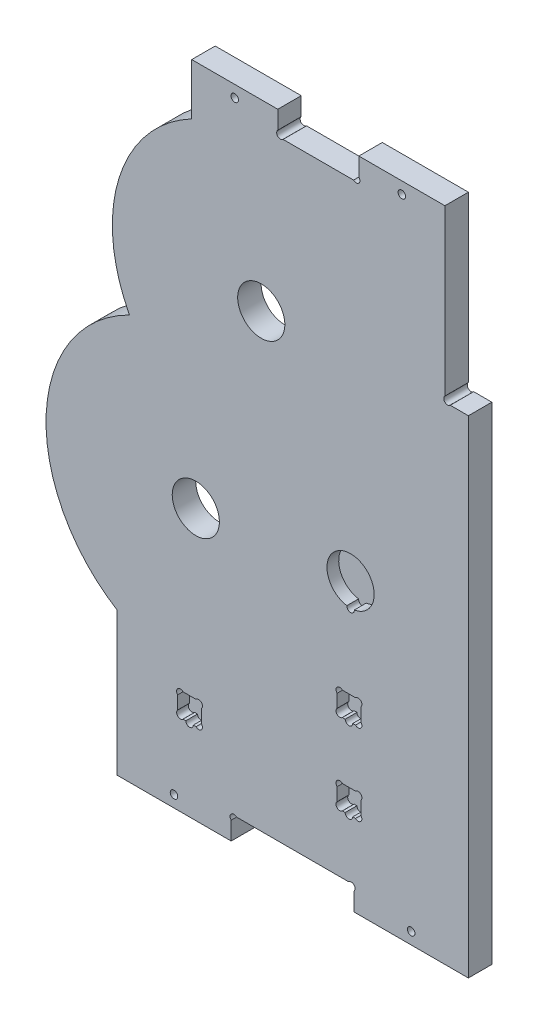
ISO-10303-21;
HEADER;
FILE_DESCRIPTION(('STEP AP214'),'2;1');
FILE_NAME('part.step','',(''),(''),'','','');
FILE_SCHEMA(('AUTOMOTIVE_DESIGN { 1 0 10303 214 1 1 1 1 }'));
ENDSEC;
DATA;
#1=APPLICATION_CONTEXT('core data for automotive mechanical design processes');
#2=APPLICATION_PROTOCOL_DEFINITION('international standard','automotive_design',2000,#1);
#3=PRODUCT_CONTEXT('',#1,'mechanical');
#4=PRODUCT('Part','Part','',(#3));
#5=PRODUCT_RELATED_PRODUCT_CATEGORY('part','',(#4));
#6=PRODUCT_DEFINITION_FORMATION('','',#4);
#7=PRODUCT_DEFINITION_CONTEXT('part definition',#1,'design');
#8=PRODUCT_DEFINITION('design','',#6,#7);
#9=PRODUCT_DEFINITION_SHAPE('','',#8);
#10=(LENGTH_UNIT() NAMED_UNIT(*) SI_UNIT(.MILLI.,.METRE.));
#11=(NAMED_UNIT(*) PLANE_ANGLE_UNIT() SI_UNIT($,.RADIAN.));
#12=(NAMED_UNIT(*) SI_UNIT($,.STERADIAN.) SOLID_ANGLE_UNIT());
#13=UNCERTAINTY_MEASURE_WITH_UNIT(LENGTH_MEASURE(1.E-05),#10,'distance_accuracy_value','');
#14=(GEOMETRIC_REPRESENTATION_CONTEXT(3) GLOBAL_UNCERTAINTY_ASSIGNED_CONTEXT((#13)) GLOBAL_UNIT_ASSIGNED_CONTEXT((#10,
#11,#12)) REPRESENTATION_CONTEXT('',''));
#15=CARTESIAN_POINT('',(0.,0.,0.));
#16=DIRECTION('',(0.,0.,1.));
#17=DIRECTION('',(1.,0.,0.));
#18=AXIS2_PLACEMENT_3D('',#15,#16,#17);
#19=CARTESIAN_POINT('',(46.6079441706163,-105.175698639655,10.));
#20=DIRECTION('',(0.,0.,-1.));
#21=DIRECTION('',(-1.,0.,0.));
#22=AXIS2_PLACEMENT_3D('',#19,#20,#21);
#23=CYLINDRICAL_SURFACE('',#22,1.6);
#24=DIRECTION('',(0.,0.,-1.));
#25=VECTOR('',#24,1.);
#26=CARTESIAN_POINT('',(48.2079441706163,-105.175698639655,10.));
#27=LINE('',#26,#25);
#28=CARTESIAN_POINT('',(48.2079441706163,-105.175698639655,10.));
#29=VERTEX_POINT('',#28);
#30=CARTESIAN_POINT('',(48.2079441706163,-105.175698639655,5.));
#31=VERTEX_POINT('',#30);
#32=EDGE_CURVE('E546',#29,#31,#27,.T.);
#33=ORIENTED_EDGE('',*,*,#32,.T.);
#34=CARTESIAN_POINT('',(46.6079441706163,-105.175698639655,5.));
#35=DIRECTION('',(0.,0.,-1.));
#36=DIRECTION('',(-1.,0.,0.));
#37=AXIS2_PLACEMENT_3D('',#34,#35,#36);
#38=CIRCLE('',#37,1.6);
#39=CARTESIAN_POINT('',(45.0079441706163,-105.175698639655,5.));
#40=VERTEX_POINT('',#39);
#41=EDGE_CURVE('E1055',#31,#40,#38,.T.);
#42=ORIENTED_EDGE('',*,*,#41,.T.);
#43=DIRECTION('',(0.,0.,-1.));
#44=VECTOR('',#43,1.);
#45=CARTESIAN_POINT('',(45.0079441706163,-105.175698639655,10.));
#46=LINE('',#45,#44);
#47=CARTESIAN_POINT('',(45.0079441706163,-105.175698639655,10.));
#48=VERTEX_POINT('',#47);
#49=EDGE_CURVE('E519',#48,#40,#46,.T.);
#50=ORIENTED_EDGE('',*,*,#49,.F.);
#51=CARTESIAN_POINT('',(46.6079441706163,-105.175698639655,10.));
#52=DIRECTION('',(0.,0.,1.));
#53=DIRECTION('',(1.,0.,0.));
#54=AXIS2_PLACEMENT_3D('',#51,#52,#53);
#55=CIRCLE('',#54,1.6);
#56=EDGE_CURVE('E498',#48,#29,#55,.T.);
#57=ORIENTED_EDGE('',*,*,#56,.T.);
#58=EDGE_LOOP('',(#33,#42,#50,#57));
#59=FACE_BOUND('',#58,.T.);
#60=ADVANCED_FACE('F33',(#59),#23,.F.);
#61=CARTESIAN_POINT('',(48.2079441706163,-105.175698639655,10.));
#62=DIRECTION('',(0.,1.,0.));
#63=DIRECTION('',(0.,0.,1.));
#64=AXIS2_PLACEMENT_3D('',#61,#62,#63);
#65=PLANE('',#64);
#66=DIRECTION('',(0.,0.,-1.));
#67=VECTOR('',#66,1.);
#68=CARTESIAN_POINT('',(49.3952024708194,-105.175698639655,10.));
#69=LINE('',#68,#67);
#70=CARTESIAN_POINT('',(49.3952024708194,-105.175698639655,10.));
#71=VERTEX_POINT('',#70);
#72=CARTESIAN_POINT('',(49.3952024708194,-105.175698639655,5.));
#73=VERTEX_POINT('',#72);
#74=EDGE_CURVE('E543',#71,#73,#69,.T.);
#75=ORIENTED_EDGE('',*,*,#74,.T.);
#76=DIRECTION('',(-1.,0.,0.));
#77=VECTOR('',#76,1.);
#78=CARTESIAN_POINT('',(48.2079441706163,-105.175698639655,5.));
#79=LINE('',#78,#77);
#80=EDGE_CURVE('E1052',#73,#31,#79,.T.);
#81=ORIENTED_EDGE('',*,*,#80,.T.);
#82=ORIENTED_EDGE('',*,*,#32,.F.);
#83=DIRECTION('',(1.,0.,0.));
#84=VECTOR('',#83,1.);
#85=CARTESIAN_POINT('',(48.2079441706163,-105.175698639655,10.));
#86=LINE('',#85,#84);
#87=EDGE_CURVE('E500',#29,#71,#86,.T.);
#88=ORIENTED_EDGE('',*,*,#87,.T.);
#89=EDGE_LOOP('',(#75,#81,#82,#88));
#90=FACE_BOUND('',#89,.T.);
#91=ADVANCED_FACE('F763',(#90),#65,.T.);
#92=CARTESIAN_POINT('',(50.5265733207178,-104.044327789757,10.));
#93=DIRECTION('',(0.,0.,-1.));
#94=DIRECTION('',(-1.,0.,0.));
#95=AXIS2_PLACEMENT_3D('',#92,#93,#94);
#96=CYLINDRICAL_SURFACE('',#95,1.59999999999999);
#97=DIRECTION('',(0.,0.,-1.));
#98=VECTOR('',#97,1.);
#99=CARTESIAN_POINT('',(51.6579441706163,-102.912956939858,10.));
#100=LINE('',#99,#98);
#101=CARTESIAN_POINT('',(51.6579441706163,-102.912956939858,10.));
#102=VERTEX_POINT('',#101);
#103=CARTESIAN_POINT('',(51.6579441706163,-102.912956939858,5.));
#104=VERTEX_POINT('',#103);
#105=EDGE_CURVE('E540',#102,#104,#100,.T.);
#106=ORIENTED_EDGE('',*,*,#105,.T.);
#107=CARTESIAN_POINT('',(50.5265733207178,-104.044327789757,5.));
#108=DIRECTION('',(0.,0.,-1.));
#109=DIRECTION('',(-1.,0.,0.));
#110=AXIS2_PLACEMENT_3D('',#107,#108,#109);
#111=CIRCLE('',#110,1.59999999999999);
#112=EDGE_CURVE('E1049',#104,#73,#111,.T.);
#113=ORIENTED_EDGE('',*,*,#112,.T.);
#114=ORIENTED_EDGE('',*,*,#74,.F.);
#115=CARTESIAN_POINT('',(50.5265733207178,-104.044327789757,10.));
#116=DIRECTION('',(0.,0.,1.));
#117=DIRECTION('',(1.,0.,0.));
#118=AXIS2_PLACEMENT_3D('',#115,#116,#117);
#119=CIRCLE('',#118,1.59999999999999);
#120=EDGE_CURVE('E502',#71,#102,#119,.T.);
#121=ORIENTED_EDGE('',*,*,#120,.T.);
#122=EDGE_LOOP('',(#106,#113,#114,#121));
#123=FACE_BOUND('',#122,.T.);
#124=ADVANCED_FACE('F768',(#123),#96,.F.);
#125=CARTESIAN_POINT('',(51.6579441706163,-102.912956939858,10.));
#126=DIRECTION('',(-1.,0.,0.));
#127=DIRECTION('',(0.,0.,1.));
#128=AXIS2_PLACEMENT_3D('',#125,#126,#127);
#129=PLANE('',#128);
#130=DIRECTION('',(0.,0.,-1.));
#131=VECTOR('',#130,1.);
#132=CARTESIAN_POINT('',(51.6579441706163,-97.3384403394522,10.));
#133=LINE('',#132,#131);
#134=CARTESIAN_POINT('',(51.6579441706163,-97.3384403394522,10.));
#135=VERTEX_POINT('',#134);
#136=CARTESIAN_POINT('',(51.6579441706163,-97.3384403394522,5.));
#137=VERTEX_POINT('',#136);
#138=EDGE_CURVE('E537',#135,#137,#133,.T.);
#139=ORIENTED_EDGE('',*,*,#138,.T.);
#140=DIRECTION('',(0.,-1.,0.));
#141=VECTOR('',#140,1.);
#142=CARTESIAN_POINT('',(51.6579441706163,-102.912956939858,5.));
#143=LINE('',#142,#141);
#144=EDGE_CURVE('E1046',#137,#104,#143,.T.);
#145=ORIENTED_EDGE('',*,*,#144,.T.);
#146=ORIENTED_EDGE('',*,*,#105,.F.);
#147=DIRECTION('',(0.,1.,0.));
#148=VECTOR('',#147,1.);
#149=CARTESIAN_POINT('',(51.6579441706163,-102.912956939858,10.));
#150=LINE('',#149,#148);
#151=EDGE_CURVE('E504',#102,#135,#150,.T.);
#152=ORIENTED_EDGE('',*,*,#151,.T.);
#153=EDGE_LOOP('',(#139,#145,#146,#152));
#154=FACE_BOUND('',#153,.T.);
#155=ADVANCED_FACE('F774',(#154),#129,.T.);
#156=CARTESIAN_POINT('',(50.5265733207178,-96.2070694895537,10.));
#157=DIRECTION('',(0.,0.,-1.));
#158=DIRECTION('',(-1.,0.,0.));
#159=AXIS2_PLACEMENT_3D('',#156,#157,#158);
#160=CYLINDRICAL_SURFACE('',#159,1.59999999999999);
#161=DIRECTION('',(0.,0.,-1.));
#162=VECTOR('',#161,1.);
#163=CARTESIAN_POINT('',(49.3952024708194,-95.0756986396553,10.));
#164=LINE('',#163,#162);
#165=CARTESIAN_POINT('',(49.3952024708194,-95.0756986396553,10.));
#166=VERTEX_POINT('',#165);
#167=CARTESIAN_POINT('',(49.3952024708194,-95.0756986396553,5.));
#168=VERTEX_POINT('',#167);
#169=EDGE_CURVE('E534',#166,#168,#164,.T.);
#170=ORIENTED_EDGE('',*,*,#169,.T.);
#171=CARTESIAN_POINT('',(50.5265733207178,-96.2070694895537,5.));
#172=DIRECTION('',(0.,0.,-1.));
#173=DIRECTION('',(-1.,0.,0.));
#174=AXIS2_PLACEMENT_3D('',#171,#172,#173);
#175=CIRCLE('',#174,1.59999999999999);
#176=EDGE_CURVE('E1043',#168,#137,#175,.T.);
#177=ORIENTED_EDGE('',*,*,#176,.T.);
#178=ORIENTED_EDGE('',*,*,#138,.F.);
#179=CARTESIAN_POINT('',(50.5265733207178,-96.2070694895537,10.));
#180=DIRECTION('',(0.,0.,1.));
#181=DIRECTION('',(-1.,0.,0.));
#182=AXIS2_PLACEMENT_3D('',#179,#180,#181);
#183=CIRCLE('',#182,1.59999999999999);
#184=EDGE_CURVE('E506',#135,#166,#183,.T.);
#185=ORIENTED_EDGE('',*,*,#184,.T.);
#186=EDGE_LOOP('',(#170,#177,#178,#185));
#187=FACE_BOUND('',#186,.T.);
#188=ADVANCED_FACE('F778',(#187),#160,.F.);
#189=CARTESIAN_POINT('',(43.8206858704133,-95.0756986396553,10.));
#190=DIRECTION('',(0.,-1.,0.));
#191=DIRECTION('',(0.,0.,-1.));
#192=AXIS2_PLACEMENT_3D('',#189,#190,#191);
#193=PLANE('',#192);
#194=DIRECTION('',(0.,0.,-1.));
#195=VECTOR('',#194,1.);
#196=CARTESIAN_POINT('',(43.8206858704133,-95.0756986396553,10.));
#197=LINE('',#196,#195);
#198=CARTESIAN_POINT('',(43.8206858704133,-95.0756986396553,10.));
#199=VERTEX_POINT('',#198);
#200=CARTESIAN_POINT('',(43.8206858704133,-95.0756986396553,5.));
#201=VERTEX_POINT('',#200);
#202=EDGE_CURVE('E531',#199,#201,#197,.T.);
#203=ORIENTED_EDGE('',*,*,#202,.T.);
#204=DIRECTION('',(1.,0.,0.));
#205=VECTOR('',#204,1.);
#206=CARTESIAN_POINT('',(43.8206858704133,-95.0756986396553,5.));
#207=LINE('',#206,#205);
#208=EDGE_CURVE('E1040',#201,#168,#207,.T.);
#209=ORIENTED_EDGE('',*,*,#208,.T.);
#210=ORIENTED_EDGE('',*,*,#169,.F.);
#211=DIRECTION('',(-1.,0.,0.));
#212=VECTOR('',#211,1.);
#213=CARTESIAN_POINT('',(43.8206858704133,-95.0756986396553,10.));
#214=LINE('',#213,#212);
#215=EDGE_CURVE('E508',#166,#199,#214,.T.);
#216=ORIENTED_EDGE('',*,*,#215,.T.);
#217=EDGE_LOOP('',(#203,#209,#210,#216));
#218=FACE_BOUND('',#217,.T.);
#219=ADVANCED_FACE('F782',(#218),#193,.T.);
#220=CARTESIAN_POINT('',(42.6893150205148,-96.2070694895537,10.));
#221=DIRECTION('',(0.,0.,-1.));
#222=DIRECTION('',(-1.,0.,0.));
#223=AXIS2_PLACEMENT_3D('',#220,#221,#222);
#224=CYLINDRICAL_SURFACE('',#223,1.59999999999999);
#225=DIRECTION('',(0.,0.,-1.));
#226=VECTOR('',#225,1.);
#227=CARTESIAN_POINT('',(41.5579441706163,-97.3384403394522,10.));
#228=LINE('',#227,#226);
#229=CARTESIAN_POINT('',(41.5579441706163,-97.3384403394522,10.));
#230=VERTEX_POINT('',#229);
#231=CARTESIAN_POINT('',(41.5579441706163,-97.3384403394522,5.));
#232=VERTEX_POINT('',#231);
#233=EDGE_CURVE('E528',#230,#232,#228,.T.);
#234=ORIENTED_EDGE('',*,*,#233,.T.);
#235=CARTESIAN_POINT('',(42.6893150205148,-96.2070694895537,5.));
#236=DIRECTION('',(0.,0.,-1.));
#237=DIRECTION('',(-1.,0.,0.));
#238=AXIS2_PLACEMENT_3D('',#235,#236,#237);
#239=CIRCLE('',#238,1.59999999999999);
#240=EDGE_CURVE('E1037',#232,#201,#239,.T.);
#241=ORIENTED_EDGE('',*,*,#240,.T.);
#242=ORIENTED_EDGE('',*,*,#202,.F.);
#243=CARTESIAN_POINT('',(42.6893150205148,-96.2070694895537,10.));
#244=DIRECTION('',(0.,0.,1.));
#245=DIRECTION('',(1.,0.,0.));
#246=AXIS2_PLACEMENT_3D('',#243,#244,#245);
#247=CIRCLE('',#246,1.59999999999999);
#248=EDGE_CURVE('E510',#199,#230,#247,.T.);
#249=ORIENTED_EDGE('',*,*,#248,.T.);
#250=EDGE_LOOP('',(#234,#241,#242,#249));
#251=FACE_BOUND('',#250,.T.);
#252=ADVANCED_FACE('F786',(#251),#224,.F.);
#253=CARTESIAN_POINT('',(41.5579441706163,-102.912956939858,10.));
#254=DIRECTION('',(1.,0.,0.));
#255=DIRECTION('',(0.,0.,-1.));
#256=AXIS2_PLACEMENT_3D('',#253,#254,#255);
#257=PLANE('',#256);
#258=DIRECTION('',(0.,0.,-1.));
#259=VECTOR('',#258,1.);
#260=CARTESIAN_POINT('',(41.5579441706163,-102.912956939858,10.));
#261=LINE('',#260,#259);
#262=CARTESIAN_POINT('',(41.5579441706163,-102.912956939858,10.));
#263=VERTEX_POINT('',#262);
#264=CARTESIAN_POINT('',(41.5579441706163,-102.912956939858,5.));
#265=VERTEX_POINT('',#264);
#266=EDGE_CURVE('E525',#263,#265,#261,.T.);
#267=ORIENTED_EDGE('',*,*,#266,.T.);
#268=DIRECTION('',(0.,1.,0.));
#269=VECTOR('',#268,1.);
#270=CARTESIAN_POINT('',(41.5579441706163,-102.912956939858,5.));
#271=LINE('',#270,#269);
#272=EDGE_CURVE('E1034',#265,#232,#271,.T.);
#273=ORIENTED_EDGE('',*,*,#272,.T.);
#274=ORIENTED_EDGE('',*,*,#233,.F.);
#275=DIRECTION('',(0.,-1.,0.));
#276=VECTOR('',#275,1.);
#277=CARTESIAN_POINT('',(41.5579441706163,-102.912956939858,10.));
#278=LINE('',#277,#276);
#279=EDGE_CURVE('E512',#230,#263,#278,.T.);
#280=ORIENTED_EDGE('',*,*,#279,.T.);
#281=EDGE_LOOP('',(#267,#273,#274,#280));
#282=FACE_BOUND('',#281,.T.);
#283=ADVANCED_FACE('F790',(#282),#257,.T.);
#284=CARTESIAN_POINT('',(42.6893150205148,-104.044327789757,10.));
#285=DIRECTION('',(0.,0.,-1.));
#286=DIRECTION('',(-1.,0.,0.));
#287=AXIS2_PLACEMENT_3D('',#284,#285,#286);
#288=CYLINDRICAL_SURFACE('',#287,1.59999999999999);
#289=DIRECTION('',(0.,0.,-1.));
#290=VECTOR('',#289,1.);
#291=CARTESIAN_POINT('',(43.8206858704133,-105.175698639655,10.));
#292=LINE('',#291,#290);
#293=CARTESIAN_POINT('',(43.8206858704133,-105.175698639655,10.));
#294=VERTEX_POINT('',#293);
#295=CARTESIAN_POINT('',(43.8206858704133,-105.175698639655,5.));
#296=VERTEX_POINT('',#295);
#297=EDGE_CURVE('E522',#294,#296,#292,.T.);
#298=ORIENTED_EDGE('',*,*,#297,.T.);
#299=CARTESIAN_POINT('',(42.6893150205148,-104.044327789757,5.));
#300=DIRECTION('',(0.,0.,-1.));
#301=DIRECTION('',(-1.,0.,0.));
#302=AXIS2_PLACEMENT_3D('',#299,#300,#301);
#303=CIRCLE('',#302,1.59999999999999);
#304=EDGE_CURVE('E48',#296,#265,#303,.T.);
#305=ORIENTED_EDGE('',*,*,#304,.T.);
#306=ORIENTED_EDGE('',*,*,#266,.F.);
#307=CARTESIAN_POINT('',(42.6893150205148,-104.044327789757,10.));
#308=DIRECTION('',(0.,0.,1.));
#309=DIRECTION('',(-1.,0.,0.));
#310=AXIS2_PLACEMENT_3D('',#307,#308,#309);
#311=CIRCLE('',#310,1.59999999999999);
#312=EDGE_CURVE('E514',#263,#294,#311,.T.);
#313=ORIENTED_EDGE('',*,*,#312,.T.);
#314=EDGE_LOOP('',(#298,#305,#306,#313));
#315=FACE_BOUND('',#314,.T.);
#316=ADVANCED_FACE('F794',(#315),#288,.F.);
#317=CARTESIAN_POINT('',(43.8206858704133,-105.175698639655,10.));
#318=DIRECTION('',(0.,1.,0.));
#319=DIRECTION('',(0.,0.,1.));
#320=AXIS2_PLACEMENT_3D('',#317,#318,#319);
#321=PLANE('',#320);
#322=ORIENTED_EDGE('',*,*,#49,.T.);
#323=DIRECTION('',(-1.,0.,0.));
#324=VECTOR('',#323,1.);
#325=CARTESIAN_POINT('',(43.8206858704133,-105.175698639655,5.));
#326=LINE('',#325,#324);
#327=EDGE_CURVE('E1031',#40,#296,#326,.T.);
#328=ORIENTED_EDGE('',*,*,#327,.T.);
#329=ORIENTED_EDGE('',*,*,#297,.F.);
#330=DIRECTION('',(1.,0.,0.));
#331=VECTOR('',#330,1.);
#332=CARTESIAN_POINT('',(43.8206858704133,-105.175698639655,10.));
#333=LINE('',#332,#331);
#334=EDGE_CURVE('E517',#294,#48,#333,.T.);
#335=ORIENTED_EDGE('',*,*,#334,.T.);
#336=EDGE_LOOP('',(#322,#328,#329,#335));
#337=FACE_BOUND('',#336,.T.);
#338=ADVANCED_FACE('F798',(#337),#321,.T.);
#339=CARTESIAN_POINT('',(50.5265733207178,-61.7422222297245,10.));
#340=DIRECTION('',(0.,0.,-1.));
#341=DIRECTION('',(-1.,0.,0.));
#342=AXIS2_PLACEMENT_3D('',#339,#340,#341);
#343=CYLINDRICAL_SURFACE('',#342,1.6);
#344=DIRECTION('',(0.,0.,-1.));
#345=VECTOR('',#344,1.);
#346=CARTESIAN_POINT('',(49.3952024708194,-60.610851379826,10.));
#347=LINE('',#346,#345);
#348=CARTESIAN_POINT('',(49.3952024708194,-60.610851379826,10.));
#349=VERTEX_POINT('',#348);
#350=CARTESIAN_POINT('',(49.3952024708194,-60.610851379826,5.));
#351=VERTEX_POINT('',#350);
#352=EDGE_CURVE('E495',#349,#351,#347,.T.);
#353=ORIENTED_EDGE('',*,*,#352,.T.);
#354=CARTESIAN_POINT('',(50.5265733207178,-61.7422222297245,5.));
#355=DIRECTION('',(0.,0.,-1.));
#356=DIRECTION('',(-1.,0.,0.));
#357=AXIS2_PLACEMENT_3D('',#354,#355,#356);
#358=CIRCLE('',#357,1.6);
#359=CARTESIAN_POINT('',(51.6579441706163,-62.873593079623,5.));
#360=VERTEX_POINT('',#359);
#361=EDGE_CURVE('E1028',#351,#360,#358,.T.);
#362=ORIENTED_EDGE('',*,*,#361,.T.);
#363=DIRECTION('',(0.,0.,-1.));
#364=VECTOR('',#363,1.);
#365=CARTESIAN_POINT('',(51.6579441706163,-62.873593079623,10.));
#366=LINE('',#365,#364);
#367=CARTESIAN_POINT('',(51.6579441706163,-62.873593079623,10.));
#368=VERTEX_POINT('',#367);
#369=EDGE_CURVE('E468',#368,#360,#366,.T.);
#370=ORIENTED_EDGE('',*,*,#369,.F.);
#371=CARTESIAN_POINT('',(50.5265733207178,-61.7422222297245,10.));
#372=DIRECTION('',(0.,0.,1.));
#373=DIRECTION('',(1.,0.,0.));
#374=AXIS2_PLACEMENT_3D('',#371,#372,#373);
#375=CIRCLE('',#374,1.6);
#376=EDGE_CURVE('E447',#368,#349,#375,.T.);
#377=ORIENTED_EDGE('',*,*,#376,.T.);
#378=EDGE_LOOP('',(#353,#362,#370,#377));
#379=FACE_BOUND('',#378,.T.);
#380=ADVANCED_FACE('F802',(#379),#343,.F.);
#381=CARTESIAN_POINT('',(43.8206858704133,-60.610851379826,10.));
#382=DIRECTION('',(0.,-1.,0.));
#383=DIRECTION('',(0.,0.,-1.));
#384=AXIS2_PLACEMENT_3D('',#381,#382,#383);
#385=PLANE('',#384);
#386=DIRECTION('',(0.,0.,-1.));
#387=VECTOR('',#386,1.);
#388=CARTESIAN_POINT('',(43.8206858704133,-60.610851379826,10.));
#389=LINE('',#388,#387);
#390=CARTESIAN_POINT('',(43.8206858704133,-60.610851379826,10.));
#391=VERTEX_POINT('',#390);
#392=CARTESIAN_POINT('',(43.8206858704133,-60.610851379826,5.));
#393=VERTEX_POINT('',#392);
#394=EDGE_CURVE('E492',#391,#393,#389,.T.);
#395=ORIENTED_EDGE('',*,*,#394,.T.);
#396=DIRECTION('',(1.,0.,0.));
#397=VECTOR('',#396,1.);
#398=CARTESIAN_POINT('',(43.8206858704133,-60.610851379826,5.));
#399=LINE('',#398,#397);
#400=EDGE_CURVE('E1025',#393,#351,#399,.T.);
#401=ORIENTED_EDGE('',*,*,#400,.T.);
#402=ORIENTED_EDGE('',*,*,#352,.F.);
#403=DIRECTION('',(-1.,0.,0.));
#404=VECTOR('',#403,1.);
#405=CARTESIAN_POINT('',(43.8206858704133,-60.610851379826,10.));
#406=LINE('',#405,#404);
#407=EDGE_CURVE('E449',#349,#391,#406,.T.);
#408=ORIENTED_EDGE('',*,*,#407,.T.);
#409=EDGE_LOOP('',(#395,#401,#402,#408));
#410=FACE_BOUND('',#409,.T.);
#411=ADVANCED_FACE('F806',(#410),#385,.T.);
#412=CARTESIAN_POINT('',(42.6893150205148,-61.7422222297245,10.));
#413=DIRECTION('',(0.,0.,-1.));
#414=DIRECTION('',(-1.,0.,0.));
#415=AXIS2_PLACEMENT_3D('',#412,#413,#414);
#416=CYLINDRICAL_SURFACE('',#415,1.6);
#417=DIRECTION('',(0.,0.,-1.));
#418=VECTOR('',#417,1.);
#419=CARTESIAN_POINT('',(41.5579441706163,-62.873593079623,10.));
#420=LINE('',#419,#418);
#421=CARTESIAN_POINT('',(41.5579441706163,-62.873593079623,10.));
#422=VERTEX_POINT('',#421);
#423=CARTESIAN_POINT('',(41.5579441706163,-62.873593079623,5.));
#424=VERTEX_POINT('',#423);
#425=EDGE_CURVE('E489',#422,#424,#420,.T.);
#426=ORIENTED_EDGE('',*,*,#425,.T.);
#427=CARTESIAN_POINT('',(42.6893150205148,-61.7422222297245,5.));
#428=DIRECTION('',(0.,0.,-1.));
#429=DIRECTION('',(-1.,0.,0.));
#430=AXIS2_PLACEMENT_3D('',#427,#428,#429);
#431=CIRCLE('',#430,1.6);
#432=EDGE_CURVE('E1022',#424,#393,#431,.T.);
#433=ORIENTED_EDGE('',*,*,#432,.T.);
#434=ORIENTED_EDGE('',*,*,#394,.F.);
#435=CARTESIAN_POINT('',(42.6893150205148,-61.7422222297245,10.));
#436=DIRECTION('',(0.,0.,1.));
#437=DIRECTION('',(-1.,0.,0.));
#438=AXIS2_PLACEMENT_3D('',#435,#436,#437);
#439=CIRCLE('',#438,1.6);
#440=EDGE_CURVE('E451',#391,#422,#439,.T.);
#441=ORIENTED_EDGE('',*,*,#440,.T.);
#442=EDGE_LOOP('',(#426,#433,#434,#441));
#443=FACE_BOUND('',#442,.T.);
#444=ADVANCED_FACE('F810',(#443),#416,.F.);
#445=CARTESIAN_POINT('',(41.5579441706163,-68.448109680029,10.));
#446=DIRECTION('',(1.,0.,0.));
#447=DIRECTION('',(0.,0.,-1.));
#448=AXIS2_PLACEMENT_3D('',#445,#446,#447);
#449=PLANE('',#448);
#450=DIRECTION('',(0.,0.,-1.));
#451=VECTOR('',#450,1.);
#452=CARTESIAN_POINT('',(41.5579441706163,-68.4481096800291,10.));
#453=LINE('',#452,#451);
#454=CARTESIAN_POINT('',(41.5579441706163,-68.4481096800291,10.));
#455=VERTEX_POINT('',#454);
#456=CARTESIAN_POINT('',(41.5579441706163,-68.4481096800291,5.));
#457=VERTEX_POINT('',#456);
#458=EDGE_CURVE('E486',#455,#457,#453,.T.);
#459=ORIENTED_EDGE('',*,*,#458,.T.);
#460=DIRECTION('',(0.,1.,0.));
#461=VECTOR('',#460,1.);
#462=CARTESIAN_POINT('',(41.5579441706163,-68.448109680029,5.));
#463=LINE('',#462,#461);
#464=EDGE_CURVE('E1019',#457,#424,#463,.T.);
#465=ORIENTED_EDGE('',*,*,#464,.T.);
#466=ORIENTED_EDGE('',*,*,#425,.F.);
#467=DIRECTION('',(0.,-1.,0.));
#468=VECTOR('',#467,1.);
#469=CARTESIAN_POINT('',(41.5579441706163,-68.448109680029,10.));
#470=LINE('',#469,#468);
#471=EDGE_CURVE('E453',#422,#455,#470,.T.);
#472=ORIENTED_EDGE('',*,*,#471,.T.);
#473=EDGE_LOOP('',(#459,#465,#466,#472));
#474=FACE_BOUND('',#473,.T.);
#475=ADVANCED_FACE('F814',(#474),#449,.T.);
#476=CARTESIAN_POINT('',(42.6893150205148,-69.5794805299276,10.));
#477=DIRECTION('',(0.,0.,-1.));
#478=DIRECTION('',(-1.,0.,0.));
#479=AXIS2_PLACEMENT_3D('',#476,#477,#478);
#480=CYLINDRICAL_SURFACE('',#479,1.6);
#481=DIRECTION('',(0.,0.,-1.));
#482=VECTOR('',#481,1.);
#483=CARTESIAN_POINT('',(43.8206858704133,-70.710851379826,10.));
#484=LINE('',#483,#482);
#485=CARTESIAN_POINT('',(43.8206858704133,-70.710851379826,10.));
#486=VERTEX_POINT('',#485);
#487=CARTESIAN_POINT('',(43.8206858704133,-70.710851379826,5.));
#488=VERTEX_POINT('',#487);
#489=EDGE_CURVE('E483',#486,#488,#484,.T.);
#490=ORIENTED_EDGE('',*,*,#489,.T.);
#491=CARTESIAN_POINT('',(42.6893150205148,-69.5794805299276,5.));
#492=DIRECTION('',(0.,0.,-1.));
#493=DIRECTION('',(-1.,0.,0.));
#494=AXIS2_PLACEMENT_3D('',#491,#492,#493);
#495=CIRCLE('',#494,1.6);
#496=EDGE_CURVE('E1016',#488,#457,#495,.T.);
#497=ORIENTED_EDGE('',*,*,#496,.T.);
#498=ORIENTED_EDGE('',*,*,#458,.F.);
#499=CARTESIAN_POINT('',(42.6893150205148,-69.5794805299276,10.));
#500=DIRECTION('',(0.,0.,1.));
#501=DIRECTION('',(1.,0.,0.));
#502=AXIS2_PLACEMENT_3D('',#499,#500,#501);
#503=CIRCLE('',#502,1.6);
#504=EDGE_CURVE('E455',#455,#486,#503,.T.);
#505=ORIENTED_EDGE('',*,*,#504,.T.);
#506=EDGE_LOOP('',(#490,#497,#498,#505));
#507=FACE_BOUND('',#506,.T.);
#508=ADVANCED_FACE('F818',(#507),#480,.F.);
#509=CARTESIAN_POINT('',(43.8206858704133,-70.710851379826,10.));
#510=DIRECTION('',(0.,1.,0.));
#511=DIRECTION('',(0.,0.,1.));
#512=AXIS2_PLACEMENT_3D('',#509,#510,#511);
#513=PLANE('',#512);
#514=DIRECTION('',(0.,0.,-1.));
#515=VECTOR('',#514,1.);
#516=CARTESIAN_POINT('',(45.0079441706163,-70.710851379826,10.));
#517=LINE('',#516,#515);
#518=CARTESIAN_POINT('',(45.0079441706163,-70.710851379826,10.));
#519=VERTEX_POINT('',#518);
#520=CARTESIAN_POINT('',(45.0079441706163,-70.710851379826,5.));
#521=VERTEX_POINT('',#520);
#522=EDGE_CURVE('E480',#519,#521,#517,.T.);
#523=ORIENTED_EDGE('',*,*,#522,.T.);
#524=DIRECTION('',(-1.,0.,0.));
#525=VECTOR('',#524,1.);
#526=CARTESIAN_POINT('',(43.8206858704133,-70.710851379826,5.));
#527=LINE('',#526,#525);
#528=EDGE_CURVE('E1013',#521,#488,#527,.T.);
#529=ORIENTED_EDGE('',*,*,#528,.T.);
#530=ORIENTED_EDGE('',*,*,#489,.F.);
#531=DIRECTION('',(1.,0.,0.));
#532=VECTOR('',#531,1.);
#533=CARTESIAN_POINT('',(43.8206858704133,-70.710851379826,10.));
#534=LINE('',#533,#532);
#535=EDGE_CURVE('E457',#486,#519,#534,.T.);
#536=ORIENTED_EDGE('',*,*,#535,.T.);
#537=EDGE_LOOP('',(#523,#529,#530,#536));
#538=FACE_BOUND('',#537,.T.);
#539=ADVANCED_FACE('F822',(#538),#513,.T.);
#540=CARTESIAN_POINT('',(46.6079441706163,-70.710851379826,10.));
#541=DIRECTION('',(0.,0.,-1.));
#542=DIRECTION('',(-1.,0.,0.));
#543=AXIS2_PLACEMENT_3D('',#540,#541,#542);
#544=CYLINDRICAL_SURFACE('',#543,1.6);
#545=DIRECTION('',(0.,0.,-1.));
#546=VECTOR('',#545,1.);
#547=CARTESIAN_POINT('',(48.2079441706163,-70.710851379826,10.));
#548=LINE('',#547,#546);
#549=CARTESIAN_POINT('',(48.2079441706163,-70.710851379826,10.));
#550=VERTEX_POINT('',#549);
#551=CARTESIAN_POINT('',(48.2079441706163,-70.710851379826,5.));
#552=VERTEX_POINT('',#551);
#553=EDGE_CURVE('E477',#550,#552,#548,.T.);
#554=ORIENTED_EDGE('',*,*,#553,.T.);
#555=CARTESIAN_POINT('',(46.6079441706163,-70.710851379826,5.));
#556=DIRECTION('',(0.,0.,-1.));
#557=DIRECTION('',(-1.,0.,0.));
#558=AXIS2_PLACEMENT_3D('',#555,#556,#557);
#559=CIRCLE('',#558,1.6);
#560=EDGE_CURVE('E1010',#552,#521,#559,.T.);
#561=ORIENTED_EDGE('',*,*,#560,.T.);
#562=ORIENTED_EDGE('',*,*,#522,.F.);
#563=CARTESIAN_POINT('',(46.6079441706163,-70.710851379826,10.));
#564=DIRECTION('',(0.,0.,1.));
#565=DIRECTION('',(1.,0.,0.));
#566=AXIS2_PLACEMENT_3D('',#563,#564,#565);
#567=CIRCLE('',#566,1.6);
#568=EDGE_CURVE('E459',#519,#550,#567,.T.);
#569=ORIENTED_EDGE('',*,*,#568,.T.);
#570=EDGE_LOOP('',(#554,#561,#562,#569));
#571=FACE_BOUND('',#570,.T.);
#572=ADVANCED_FACE('F826',(#571),#544,.F.);
#573=CARTESIAN_POINT('',(48.2079441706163,-70.710851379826,10.));
#574=DIRECTION('',(0.,1.,0.));
#575=DIRECTION('',(0.,0.,1.));
#576=AXIS2_PLACEMENT_3D('',#573,#574,#575);
#577=PLANE('',#576);
#578=DIRECTION('',(0.,0.,-1.));
#579=VECTOR('',#578,1.);
#580=CARTESIAN_POINT('',(49.3952024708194,-70.710851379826,10.));
#581=LINE('',#580,#579);
#582=CARTESIAN_POINT('',(49.3952024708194,-70.710851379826,10.));
#583=VERTEX_POINT('',#582);
#584=CARTESIAN_POINT('',(49.3952024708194,-70.710851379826,5.));
#585=VERTEX_POINT('',#584);
#586=EDGE_CURVE('E474',#583,#585,#581,.T.);
#587=ORIENTED_EDGE('',*,*,#586,.T.);
#588=DIRECTION('',(-1.,0.,0.));
#589=VECTOR('',#588,1.);
#590=CARTESIAN_POINT('',(48.2079441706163,-70.710851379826,5.));
#591=LINE('',#590,#589);
#592=EDGE_CURVE('E1007',#585,#552,#591,.T.);
#593=ORIENTED_EDGE('',*,*,#592,.T.);
#594=ORIENTED_EDGE('',*,*,#553,.F.);
#595=DIRECTION('',(1.,0.,0.));
#596=VECTOR('',#595,1.);
#597=CARTESIAN_POINT('',(48.2079441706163,-70.710851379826,10.));
#598=LINE('',#597,#596);
#599=EDGE_CURVE('E461',#550,#583,#598,.T.);
#600=ORIENTED_EDGE('',*,*,#599,.T.);
#601=EDGE_LOOP('',(#587,#593,#594,#600));
#602=FACE_BOUND('',#601,.T.);
#603=ADVANCED_FACE('F830',(#602),#577,.T.);
#604=CARTESIAN_POINT('',(50.5265733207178,-69.5794805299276,10.));
#605=DIRECTION('',(0.,0.,-1.));
#606=DIRECTION('',(-1.,0.,0.));
#607=AXIS2_PLACEMENT_3D('',#604,#605,#606);
#608=CYLINDRICAL_SURFACE('',#607,1.6);
#609=DIRECTION('',(0.,0.,-1.));
#610=VECTOR('',#609,1.);
#611=CARTESIAN_POINT('',(51.6579441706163,-68.448109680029,10.));
#612=LINE('',#611,#610);
#613=CARTESIAN_POINT('',(51.6579441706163,-68.448109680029,10.));
#614=VERTEX_POINT('',#613);
#615=CARTESIAN_POINT('',(51.6579441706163,-68.448109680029,5.));
#616=VERTEX_POINT('',#615);
#617=EDGE_CURVE('E471',#614,#616,#612,.T.);
#618=ORIENTED_EDGE('',*,*,#617,.T.);
#619=CARTESIAN_POINT('',(50.5265733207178,-69.5794805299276,5.));
#620=DIRECTION('',(0.,0.,-1.));
#621=DIRECTION('',(-1.,0.,0.));
#622=AXIS2_PLACEMENT_3D('',#619,#620,#621);
#623=CIRCLE('',#622,1.6);
#624=EDGE_CURVE('E56',#616,#585,#623,.T.);
#625=ORIENTED_EDGE('',*,*,#624,.T.);
#626=ORIENTED_EDGE('',*,*,#586,.F.);
#627=CARTESIAN_POINT('',(50.5265733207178,-69.5794805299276,10.));
#628=DIRECTION('',(0.,0.,1.));
#629=DIRECTION('',(-1.,0.,0.));
#630=AXIS2_PLACEMENT_3D('',#627,#628,#629);
#631=CIRCLE('',#630,1.6);
#632=EDGE_CURVE('E463',#583,#614,#631,.T.);
#633=ORIENTED_EDGE('',*,*,#632,.T.);
#634=EDGE_LOOP('',(#618,#625,#626,#633));
#635=FACE_BOUND('',#634,.T.);
#636=ADVANCED_FACE('F834',(#635),#608,.F.);
#637=CARTESIAN_POINT('',(51.6579441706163,-68.448109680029,10.));
#638=DIRECTION('',(-1.,0.,0.));
#639=DIRECTION('',(0.,0.,1.));
#640=AXIS2_PLACEMENT_3D('',#637,#638,#639);
#641=PLANE('',#640);
#642=ORIENTED_EDGE('',*,*,#369,.T.);
#643=DIRECTION('',(0.,-1.,0.));
#644=VECTOR('',#643,1.);
#645=CARTESIAN_POINT('',(51.6579441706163,-68.448109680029,5.));
#646=LINE('',#645,#644);
#647=EDGE_CURVE('E983',#360,#616,#646,.T.);
#648=ORIENTED_EDGE('',*,*,#647,.T.);
#649=ORIENTED_EDGE('',*,*,#617,.F.);
#650=DIRECTION('',(0.,1.,0.));
#651=VECTOR('',#650,1.);
#652=CARTESIAN_POINT('',(51.6579441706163,-68.448109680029,10.));
#653=LINE('',#652,#651);
#654=EDGE_CURVE('E466',#614,#368,#653,.T.);
#655=ORIENTED_EDGE('',*,*,#654,.T.);
#656=EDGE_LOOP('',(#642,#648,#649,#655));
#657=FACE_BOUND('',#656,.T.);
#658=ADVANCED_FACE('F838',(#657),#641,.T.);
#659=CARTESIAN_POINT('',(-17.4105787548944,-96.2991884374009,10.));
#660=DIRECTION('',(0.,0.,-1.));
#661=DIRECTION('',(-1.,0.,0.));
#662=AXIS2_PLACEMENT_3D('',#659,#660,#661);
#663=CYLINDRICAL_SURFACE('',#662,1.6);
#664=DIRECTION('',(0.,0.,-1.));
#665=VECTOR('',#664,1.);
#666=CARTESIAN_POINT('',(-18.5519661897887,-95.17792365,10.));
#667=LINE('',#666,#665);
#668=CARTESIAN_POINT('',(-18.5519661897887,-95.17792365,10.));
#669=VERTEX_POINT('',#668);
#670=CARTESIAN_POINT('',(-18.5519661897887,-95.17792365,5.));
#671=VERTEX_POINT('',#670);
#672=EDGE_CURVE('E444',#669,#671,#667,.T.);
#673=ORIENTED_EDGE('',*,*,#672,.T.);
#674=CARTESIAN_POINT('',(-17.4105787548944,-96.2991884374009,5.));
#675=DIRECTION('',(0.,0.,-1.));
#676=DIRECTION('',(-1.,0.,0.));
#677=AXIS2_PLACEMENT_3D('',#674,#675,#676);
#678=CIRCLE('',#677,1.6);
#679=CARTESIAN_POINT('',(-16.26919132,-97.4204532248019,5.));
#680=VERTEX_POINT('',#679);
#681=EDGE_CURVE('E977',#671,#680,#678,.T.);
#682=ORIENTED_EDGE('',*,*,#681,.T.);
#683=DIRECTION('',(0.,0.,-1.));
#684=VECTOR('',#683,1.);
#685=CARTESIAN_POINT('',(-16.26919132,-97.4204532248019,10.));
#686=LINE('',#685,#684);
#687=CARTESIAN_POINT('',(-16.26919132,-97.4204532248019,10.));
#688=VERTEX_POINT('',#687);
#689=EDGE_CURVE('E417',#688,#680,#686,.T.);
#690=ORIENTED_EDGE('',*,*,#689,.F.);
#691=CARTESIAN_POINT('',(-17.4105787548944,-96.2991884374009,10.));
#692=DIRECTION('',(0.,0.,1.));
#693=DIRECTION('',(1.,0.,0.));
#694=AXIS2_PLACEMENT_3D('',#691,#692,#693);
#695=CIRCLE('',#694,1.6);
#696=EDGE_CURVE('E391',#688,#669,#695,.T.);
#697=ORIENTED_EDGE('',*,*,#696,.T.);
#698=EDGE_LOOP('',(#673,#682,#690,#697));
#699=FACE_BOUND('',#698,.T.);
#700=ADVANCED_FACE('F842',(#699),#663,.F.);
#701=CARTESIAN_POINT('',(-24.0864164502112,-95.17792365,10.));
#702=DIRECTION('',(0.,-1.,0.));
#703=DIRECTION('',(0.,0.,-1.));
#704=AXIS2_PLACEMENT_3D('',#701,#702,#703);
#705=PLANE('',#704);
#706=DIRECTION('',(0.,0.,-1.));
#707=VECTOR('',#706,1.);
#708=CARTESIAN_POINT('',(-24.0864164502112,-95.17792365,10.));
#709=LINE('',#708,#707);
#710=CARTESIAN_POINT('',(-24.0864164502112,-95.17792365,10.));
#711=VERTEX_POINT('',#710);
#712=CARTESIAN_POINT('',(-24.0864164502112,-95.17792365,5.));
#713=VERTEX_POINT('',#712);
#714=EDGE_CURVE('E441',#711,#713,#709,.T.);
#715=ORIENTED_EDGE('',*,*,#714,.T.);
#716=DIRECTION('',(1.,0.,0.));
#717=VECTOR('',#716,1.);
#718=CARTESIAN_POINT('',(-24.0864164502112,-95.17792365,5.));
#719=LINE('',#718,#717);
#720=EDGE_CURVE('E979',#713,#671,#719,.T.);
#721=ORIENTED_EDGE('',*,*,#720,.T.);
#722=ORIENTED_EDGE('',*,*,#672,.F.);
#723=DIRECTION('',(-1.,0.,0.));
#724=VECTOR('',#723,1.);
#725=CARTESIAN_POINT('',(-24.0864164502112,-95.17792365,10.));
#726=LINE('',#725,#724);
#727=EDGE_CURVE('E398',#669,#711,#726,.T.);
#728=ORIENTED_EDGE('',*,*,#727,.T.);
#729=EDGE_LOOP('',(#715,#721,#722,#728));
#730=FACE_BOUND('',#729,.T.);
#731=ADVANCED_FACE('F846',(#730),#705,.T.);
#732=CARTESIAN_POINT('',(-25.2278038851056,-96.2991884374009,10.));
#733=DIRECTION('',(0.,0.,-1.));
#734=DIRECTION('',(-1.,0.,0.));
#735=AXIS2_PLACEMENT_3D('',#732,#733,#734);
#736=CYLINDRICAL_SURFACE('',#735,1.6);
#737=DIRECTION('',(0.,0.,-1.));
#738=VECTOR('',#737,1.);
#739=CARTESIAN_POINT('',(-26.36919132,-97.4204532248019,10.));
#740=LINE('',#739,#738);
#741=CARTESIAN_POINT('',(-26.36919132,-97.4204532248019,10.));
#742=VERTEX_POINT('',#741);
#743=CARTESIAN_POINT('',(-26.36919132,-97.4204532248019,5.));
#744=VERTEX_POINT('',#743);
#745=EDGE_CURVE('E438',#742,#744,#740,.T.);
#746=ORIENTED_EDGE('',*,*,#745,.T.);
#747=CARTESIAN_POINT('',(-25.2278038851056,-96.2991884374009,5.));
#748=DIRECTION('',(0.,0.,-1.));
#749=DIRECTION('',(-1.,0.,0.));
#750=AXIS2_PLACEMENT_3D('',#747,#748,#749);
#751=CIRCLE('',#750,1.6);
#752=EDGE_CURVE('E988',#744,#713,#751,.T.);
#753=ORIENTED_EDGE('',*,*,#752,.T.);
#754=ORIENTED_EDGE('',*,*,#714,.F.);
#755=CARTESIAN_POINT('',(-25.2278038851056,-96.2991884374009,10.));
#756=DIRECTION('',(0.,0.,1.));
#757=DIRECTION('',(-1.,0.,0.));
#758=AXIS2_PLACEMENT_3D('',#755,#756,#757);
#759=CIRCLE('',#758,1.6);
#760=EDGE_CURVE('E400',#711,#742,#759,.T.);
#761=ORIENTED_EDGE('',*,*,#760,.T.);
#762=EDGE_LOOP('',(#746,#753,#754,#761));
#763=FACE_BOUND('',#762,.T.);
#764=ADVANCED_FACE('F850',(#763),#736,.F.);
#765=CARTESIAN_POINT('',(-26.36919132,-103.035394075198,10.));
#766=DIRECTION('',(1.,0.,0.));
#767=DIRECTION('',(0.,0.,-1.));
#768=AXIS2_PLACEMENT_3D('',#765,#766,#767);
#769=PLANE('',#768);
#770=DIRECTION('',(0.,0.,-1.));
#771=VECTOR('',#770,1.);
#772=CARTESIAN_POINT('',(-26.36919132,-103.035394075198,10.));
#773=LINE('',#772,#771);
#774=CARTESIAN_POINT('',(-26.36919132,-103.035394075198,10.));
#775=VERTEX_POINT('',#774);
#776=CARTESIAN_POINT('',(-26.36919132,-103.035394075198,5.));
#777=VERTEX_POINT('',#776);
#778=EDGE_CURVE('E435',#775,#777,#773,.T.);
#779=ORIENTED_EDGE('',*,*,#778,.T.);
#780=DIRECTION('',(0.,1.,0.));
#781=VECTOR('',#780,1.);
#782=CARTESIAN_POINT('',(-26.36919132,-103.035394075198,5.));
#783=LINE('',#782,#781);
#784=EDGE_CURVE('E999',#777,#744,#783,.T.);
#785=ORIENTED_EDGE('',*,*,#784,.T.);
#786=ORIENTED_EDGE('',*,*,#745,.F.);
#787=DIRECTION('',(0.,-1.,0.));
#788=VECTOR('',#787,1.);
#789=CARTESIAN_POINT('',(-26.36919132,-103.035394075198,10.));
#790=LINE('',#789,#788);
#791=EDGE_CURVE('E402',#742,#775,#790,.T.);
#792=ORIENTED_EDGE('',*,*,#791,.T.);
#793=EDGE_LOOP('',(#779,#785,#786,#792));
#794=FACE_BOUND('',#793,.T.);
#795=ADVANCED_FACE('F854',(#794),#769,.T.);
#796=CARTESIAN_POINT('',(-25.2278038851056,-104.156658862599,10.));
#797=DIRECTION('',(0.,0.,-1.));
#798=DIRECTION('',(-1.,0.,0.));
#799=AXIS2_PLACEMENT_3D('',#796,#797,#798);
#800=CYLINDRICAL_SURFACE('',#799,1.6);
#801=DIRECTION('',(0.,0.,-1.));
#802=VECTOR('',#801,1.);
#803=CARTESIAN_POINT('',(-24.0864164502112,-105.27792365,10.));
#804=LINE('',#803,#802);
#805=CARTESIAN_POINT('',(-24.0864164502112,-105.27792365,10.));
#806=VERTEX_POINT('',#805);
#807=CARTESIAN_POINT('',(-24.0864164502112,-105.27792365,5.));
#808=VERTEX_POINT('',#807);
#809=EDGE_CURVE('E432',#806,#808,#804,.T.);
#810=ORIENTED_EDGE('',*,*,#809,.T.);
#811=CARTESIAN_POINT('',(-25.2278038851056,-104.156658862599,5.));
#812=DIRECTION('',(0.,0.,-1.));
#813=DIRECTION('',(-1.,0.,0.));
#814=AXIS2_PLACEMENT_3D('',#811,#812,#813);
#815=CIRCLE('',#814,1.6);
#816=EDGE_CURVE('E1001',#808,#777,#815,.T.);
#817=ORIENTED_EDGE('',*,*,#816,.T.);
#818=ORIENTED_EDGE('',*,*,#778,.F.);
#819=CARTESIAN_POINT('',(-25.2278038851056,-104.156658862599,10.));
#820=DIRECTION('',(0.,0.,1.));
#821=DIRECTION('',(1.,0.,0.));
#822=AXIS2_PLACEMENT_3D('',#819,#820,#821);
#823=CIRCLE('',#822,1.6);
#824=EDGE_CURVE('E404',#775,#806,#823,.T.);
#825=ORIENTED_EDGE('',*,*,#824,.T.);
#826=EDGE_LOOP('',(#810,#817,#818,#825));
#827=FACE_BOUND('',#826,.T.);
#828=ADVANCED_FACE('F858',(#827),#800,.F.);
#829=CARTESIAN_POINT('',(-24.0864164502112,-105.27792365,10.));
#830=DIRECTION('',(0.,1.,0.));
#831=DIRECTION('',(0.,0.,1.));
#832=AXIS2_PLACEMENT_3D('',#829,#830,#831);
#833=PLANE('',#832);
#834=DIRECTION('',(0.,0.,-1.));
#835=VECTOR('',#834,1.);
#836=CARTESIAN_POINT('',(-22.91919132,-105.27792365,10.));
#837=LINE('',#836,#835);
#838=CARTESIAN_POINT('',(-22.91919132,-105.27792365,10.));
#839=VERTEX_POINT('',#838);
#840=CARTESIAN_POINT('',(-22.91919132,-105.27792365,5.));
#841=VERTEX_POINT('',#840);
#842=EDGE_CURVE('E429',#839,#841,#837,.T.);
#843=ORIENTED_EDGE('',*,*,#842,.T.);
#844=DIRECTION('',(-1.,0.,0.));
#845=VECTOR('',#844,1.);
#846=CARTESIAN_POINT('',(-24.0864164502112,-105.27792365,5.));
#847=LINE('',#846,#845);
#848=EDGE_CURVE('E1579',#841,#808,#847,.T.);
#849=ORIENTED_EDGE('',*,*,#848,.T.);
#850=ORIENTED_EDGE('',*,*,#809,.F.);
#851=DIRECTION('',(1.,0.,0.));
#852=VECTOR('',#851,1.);
#853=CARTESIAN_POINT('',(-24.0864164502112,-105.27792365,10.));
#854=LINE('',#853,#852);
#855=EDGE_CURVE('E406',#806,#839,#854,.T.);
#856=ORIENTED_EDGE('',*,*,#855,.T.);
#857=EDGE_LOOP('',(#843,#849,#850,#856));
#858=FACE_BOUND('',#857,.T.);
#859=ADVANCED_FACE('F862',(#858),#833,.T.);
#860=CARTESIAN_POINT('',(-21.31919132,-105.27792365,10.));
#861=DIRECTION('',(0.,0.,-1.));
#862=DIRECTION('',(-1.,0.,0.));
#863=AXIS2_PLACEMENT_3D('',#860,#861,#862);
#864=CYLINDRICAL_SURFACE('',#863,1.6);
#865=DIRECTION('',(0.,0.,-1.));
#866=VECTOR('',#865,1.);
#867=CARTESIAN_POINT('',(-19.71919132,-105.27792365,10.));
#868=LINE('',#867,#866);
#869=CARTESIAN_POINT('',(-19.71919132,-105.27792365,10.));
#870=VERTEX_POINT('',#869);
#871=CARTESIAN_POINT('',(-19.71919132,-105.27792365,5.));
#872=VERTEX_POINT('',#871);
#873=EDGE_CURVE('E426',#870,#872,#868,.T.);
#874=ORIENTED_EDGE('',*,*,#873,.T.);
#875=CARTESIAN_POINT('',(-21.31919132,-105.27792365,5.));
#876=DIRECTION('',(0.,0.,-1.));
#877=DIRECTION('',(-1.,0.,0.));
#878=AXIS2_PLACEMENT_3D('',#875,#876,#877);
#879=CIRCLE('',#878,1.6);
#880=EDGE_CURVE('E1582',#872,#841,#879,.T.);
#881=ORIENTED_EDGE('',*,*,#880,.T.);
#882=ORIENTED_EDGE('',*,*,#842,.F.);
#883=CARTESIAN_POINT('',(-21.31919132,-105.27792365,10.));
#884=DIRECTION('',(0.,0.,1.));
#885=DIRECTION('',(1.,0.,0.));
#886=AXIS2_PLACEMENT_3D('',#883,#884,#885);
#887=CIRCLE('',#886,1.6);
#888=EDGE_CURVE('E408',#839,#870,#887,.T.);
#889=ORIENTED_EDGE('',*,*,#888,.T.);
#890=EDGE_LOOP('',(#874,#881,#882,#889));
#891=FACE_BOUND('',#890,.T.);
#892=ADVANCED_FACE('F866',(#891),#864,.F.);
#893=CARTESIAN_POINT('',(-19.71919132,-105.27792365,10.));
#894=DIRECTION('',(0.,1.,0.));
#895=DIRECTION('',(0.,0.,1.));
#896=AXIS2_PLACEMENT_3D('',#893,#894,#895);
#897=PLANE('',#896);
#898=DIRECTION('',(0.,0.,-1.));
#899=VECTOR('',#898,1.);
#900=CARTESIAN_POINT('',(-18.5519661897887,-105.27792365,10.));
#901=LINE('',#900,#899);
#902=CARTESIAN_POINT('',(-18.5519661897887,-105.27792365,10.));
#903=VERTEX_POINT('',#902);
#904=CARTESIAN_POINT('',(-18.5519661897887,-105.27792365,5.));
#905=VERTEX_POINT('',#904);
#906=EDGE_CURVE('E423',#903,#905,#901,.T.);
#907=ORIENTED_EDGE('',*,*,#906,.T.);
#908=DIRECTION('',(-1.,0.,0.));
#909=VECTOR('',#908,1.);
#910=CARTESIAN_POINT('',(-19.71919132,-105.27792365,5.));
#911=LINE('',#910,#909);
#912=EDGE_CURVE('E1585',#905,#872,#911,.T.);
#913=ORIENTED_EDGE('',*,*,#912,.T.);
#914=ORIENTED_EDGE('',*,*,#873,.F.);
#915=DIRECTION('',(1.,0.,0.));
#916=VECTOR('',#915,1.);
#917=CARTESIAN_POINT('',(-19.71919132,-105.27792365,10.));
#918=LINE('',#917,#916);
#919=EDGE_CURVE('E410',#870,#903,#918,.T.);
#920=ORIENTED_EDGE('',*,*,#919,.T.);
#921=EDGE_LOOP('',(#907,#913,#914,#920));
#922=FACE_BOUND('',#921,.T.);
#923=ADVANCED_FACE('F870',(#922),#897,.T.);
#924=CARTESIAN_POINT('',(-17.4105787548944,-104.156658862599,10.));
#925=DIRECTION('',(0.,0.,-1.));
#926=DIRECTION('',(-1.,0.,0.));
#927=AXIS2_PLACEMENT_3D('',#924,#925,#926);
#928=CYLINDRICAL_SURFACE('',#927,1.6);
#929=DIRECTION('',(0.,0.,-1.));
#930=VECTOR('',#929,1.);
#931=CARTESIAN_POINT('',(-16.26919132,-103.035394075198,10.));
#932=LINE('',#931,#930);
#933=CARTESIAN_POINT('',(-16.26919132,-103.035394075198,10.));
#934=VERTEX_POINT('',#933);
#935=CARTESIAN_POINT('',(-16.26919132,-103.035394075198,5.));
#936=VERTEX_POINT('',#935);
#937=EDGE_CURVE('E420',#934,#936,#932,.T.);
#938=ORIENTED_EDGE('',*,*,#937,.T.);
#939=CARTESIAN_POINT('',(-17.4105787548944,-104.156658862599,5.));
#940=DIRECTION('',(0.,0.,-1.));
#941=DIRECTION('',(-1.,0.,0.));
#942=AXIS2_PLACEMENT_3D('',#939,#940,#941);
#943=CIRCLE('',#942,1.6);
#944=EDGE_CURVE('E1588',#936,#905,#943,.T.);
#945=ORIENTED_EDGE('',*,*,#944,.T.);
#946=ORIENTED_EDGE('',*,*,#906,.F.);
#947=CARTESIAN_POINT('',(-17.4105787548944,-104.156658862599,10.));
#948=DIRECTION('',(0.,0.,1.));
#949=DIRECTION('',(-1.,0.,0.));
#950=AXIS2_PLACEMENT_3D('',#947,#948,#949);
#951=CIRCLE('',#950,1.6);
#952=EDGE_CURVE('E412',#903,#934,#951,.T.);
#953=ORIENTED_EDGE('',*,*,#952,.T.);
#954=EDGE_LOOP('',(#938,#945,#946,#953));
#955=FACE_BOUND('',#954,.T.);
#956=ADVANCED_FACE('F874',(#955),#928,.F.);
#957=CARTESIAN_POINT('',(-16.26919132,-103.035394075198,10.));
#958=DIRECTION('',(-1.,0.,0.));
#959=DIRECTION('',(0.,0.,1.));
#960=AXIS2_PLACEMENT_3D('',#957,#958,#959);
#961=PLANE('',#960);
#962=ORIENTED_EDGE('',*,*,#689,.T.);
#963=DIRECTION('',(0.,-1.,0.));
#964=VECTOR('',#963,1.);
#965=CARTESIAN_POINT('',(-16.26919132,-103.035394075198,5.));
#966=LINE('',#965,#964);
#967=EDGE_CURVE('E385',#680,#936,#966,.T.);
#968=ORIENTED_EDGE('',*,*,#967,.T.);
#969=ORIENTED_EDGE('',*,*,#937,.F.);
#970=DIRECTION('',(0.,1.,0.));
#971=VECTOR('',#970,1.);
#972=CARTESIAN_POINT('',(-16.26919132,-103.035394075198,10.));
#973=LINE('',#972,#971);
#974=EDGE_CURVE('E415',#934,#688,#973,.T.);
#975=ORIENTED_EDGE('',*,*,#974,.T.);
#976=EDGE_LOOP('',(#962,#968,#969,#975));
#977=FACE_BOUND('',#976,.T.);
#978=ADVANCED_FACE('F878',(#977),#961,.T.);
#979=CARTESIAN_POINT('',(47.2999999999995,-28.6100000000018,10.));
#980=DIRECTION('',(0.,0.,-1.));
#981=DIRECTION('',(-1.,0.,0.));
#982=AXIS2_PLACEMENT_3D('',#979,#980,#981);
#983=CYLINDRICAL_SURFACE('',#982,1.6);
#984=DIRECTION('',(0.,0.,-1.));
#985=VECTOR('',#984,1.);
#986=CARTESIAN_POINT('',(48.8949227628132,-28.4826368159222,10.));
#987=LINE('',#986,#985);
#988=CARTESIAN_POINT('',(48.8949227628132,-28.4826368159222,10.));
#989=VERTEX_POINT('',#988);
#990=CARTESIAN_POINT('',(48.8949227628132,-28.4826368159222,5.));
#991=VERTEX_POINT('',#990);
#992=EDGE_CURVE('E384',#989,#991,#987,.T.);
#993=ORIENTED_EDGE('',*,*,#992,.T.);
#994=CARTESIAN_POINT('',(47.2999999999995,-28.6100000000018,5.));
#995=DIRECTION('',(0.,0.,-1.));
#996=DIRECTION('',(-1.,0.,0.));
#997=AXIS2_PLACEMENT_3D('',#994,#995,#996);
#998=CIRCLE('',#997,1.6);
#999=CARTESIAN_POINT('',(45.7050772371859,-28.4826368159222,5.));
#1000=VERTEX_POINT('',#999);
#1001=EDGE_CURVE('E374',#991,#1000,#998,.T.);
#1002=ORIENTED_EDGE('',*,*,#1001,.T.);
#1003=DIRECTION('',(0.,0.,-1.));
#1004=VECTOR('',#1003,1.);
#1005=CARTESIAN_POINT('',(45.7050772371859,-28.4826368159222,10.));
#1006=LINE('',#1005,#1004);
#1007=CARTESIAN_POINT('',(45.7050772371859,-28.4826368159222,10.));
#1008=VERTEX_POINT('',#1007);
#1009=EDGE_CURVE('E382',#1008,#1000,#1006,.T.);
#1010=ORIENTED_EDGE('',*,*,#1009,.F.);
#1011=CARTESIAN_POINT('',(47.2999999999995,-28.6100000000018,10.));
#1012=DIRECTION('',(0.,0.,1.));
#1013=DIRECTION('',(1.,0.,0.));
#1014=AXIS2_PLACEMENT_3D('',#1011,#1012,#1013);
#1015=CIRCLE('',#1014,1.6);
#1016=EDGE_CURVE('E393',#1008,#989,#1015,.T.);
#1017=ORIENTED_EDGE('',*,*,#1016,.T.);
#1018=EDGE_LOOP('',(#993,#1002,#1010,#1017));
#1019=FACE_BOUND('',#1018,.T.);
#1020=ADVANCED_FACE('F380',(#1019),#983,.F.);
#1021=CARTESIAN_POINT('',(47.2999999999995,-18.5600000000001,10.));
#1022=DIRECTION('',(0.,0.,-1.));
#1023=DIRECTION('',(-1.,0.,0.));
#1024=AXIS2_PLACEMENT_3D('',#1021,#1022,#1023);
#1025=CYLINDRICAL_SURFACE('',#1024,10.0500000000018);
#1026=ORIENTED_EDGE('',*,*,#1009,.T.);
#1027=CARTESIAN_POINT('',(47.2999999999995,-18.5600000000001,5.));
#1028=DIRECTION('',(0.,0.,-1.));
#1029=DIRECTION('',(-1.,0.,0.));
#1030=AXIS2_PLACEMENT_3D('',#1027,#1028,#1029);
#1031=CIRCLE('',#1030,10.0500000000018);
#1032=EDGE_CURVE('E11',#1000,#991,#1031,.T.);
#1033=ORIENTED_EDGE('',*,*,#1032,.T.);
#1034=ORIENTED_EDGE('',*,*,#992,.F.);
#1035=CARTESIAN_POINT('',(47.2999999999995,-18.5600000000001,10.));
#1036=DIRECTION('',(0.,0.,1.));
#1037=DIRECTION('',(1.,0.,0.));
#1038=AXIS2_PLACEMENT_3D('',#1035,#1036,#1037);
#1039=CIRCLE('',#1038,10.0500000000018);
#1040=EDGE_CURVE('E389',#989,#1008,#1039,.T.);
#1041=ORIENTED_EDGE('',*,*,#1040,.T.);
#1042=EDGE_LOOP('',(#1026,#1033,#1034,#1041));
#1043=FACE_BOUND('',#1042,.T.);
#1044=ADVANCED_FACE('F387',(#1043),#1025,.F.);
#1045=CARTESIAN_POINT('',(-20.3799999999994,140.,10.));
#1046=DIRECTION('',(0.,-1.,0.));
#1047=DIRECTION('',(0.,0.,-1.));
#1048=AXIS2_PLACEMENT_3D('',#1045,#1046,#1047);
#1049=PLANE('',#1048);
#1050=DIRECTION('',(-1.,0.,0.));
#1051=VECTOR('',#1050,1.);
#1052=CARTESIAN_POINT('',(-20.3799999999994,140.,0.));
#1053=LINE('',#1052,#1051);
#1054=CARTESIAN_POINT('',(87.4999999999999,140.,0.));
#1055=VERTEX_POINT('',#1054);
#1056=CARTESIAN_POINT('',(50.8199999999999,140.,0.));
#1057=VERTEX_POINT('',#1056);
#1058=EDGE_CURVE('E574',#1055,#1057,#1053,.T.);
#1059=ORIENTED_EDGE('',*,*,#1058,.T.);
#1060=DIRECTION('',(0.,0.,-1.));
#1061=VECTOR('',#1060,1.);
#1062=CARTESIAN_POINT('',(50.8199999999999,140.,10.));
#1063=LINE('',#1062,#1061);
#1064=CARTESIAN_POINT('',(50.8199999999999,140.,10.));
#1065=VERTEX_POINT('',#1064);
#1066=EDGE_CURVE('E640',#1065,#1057,#1063,.T.);
#1067=ORIENTED_EDGE('',*,*,#1066,.F.);
#1068=DIRECTION('',(-1.,0.,0.));
#1069=VECTOR('',#1068,1.);
#1070=CARTESIAN_POINT('',(-20.3799999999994,140.,10.));
#1071=LINE('',#1070,#1069);
#1072=CARTESIAN_POINT('',(87.4999999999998,140.,10.));
#1073=VERTEX_POINT('',#1072);
#1074=EDGE_CURVE('E555',#1073,#1065,#1071,.T.);
#1075=ORIENTED_EDGE('',*,*,#1074,.F.);
#1076=DIRECTION('',(0.,0.,1.));
#1077=VECTOR('',#1076,1.);
#1078=CARTESIAN_POINT('',(87.4999999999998,140.,0.));
#1079=LINE('',#1078,#1077);
#1080=EDGE_CURVE('E674',#1055,#1073,#1079,.T.);
#1081=ORIENTED_EDGE('',*,*,#1080,.F.);
#1082=EDGE_LOOP('',(#1059,#1067,#1075,#1081));
#1083=FACE_BOUND('',#1082,.T.);
#1084=ADVANCED_FACE('F755',(#1083),#1049,.F.);
#1085=CARTESIAN_POINT('',(-52.3221983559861,-140.000000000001,10.));
#1086=DIRECTION('',(0.,1.,0.));
#1087=DIRECTION('',(-1.,0.,0.));
#1088=AXIS2_PLACEMENT_3D('',#1085,#1086,#1087);
#1089=PLANE('',#1088);
#1090=DIRECTION('',(1.,0.,0.));
#1091=VECTOR('',#1090,1.);
#1092=CARTESIAN_POINT('',(-52.3221983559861,-140.000000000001,0.));
#1093=LINE('',#1092,#1091);
#1094=CARTESIAN_POINT('',(-52.3221983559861,-140.000000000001,0.));
#1095=VERTEX_POINT('',#1094);
#1096=CARTESIAN_POINT('',(-3.57219835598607,-140.,0.));
#1097=VERTEX_POINT('',#1096);
#1098=EDGE_CURVE('E554',#1095,#1097,#1093,.T.);
#1099=ORIENTED_EDGE('',*,*,#1098,.T.);
#1100=DIRECTION('',(0.,0.,1.));
#1101=VECTOR('',#1100,1.);
#1102=CARTESIAN_POINT('',(-3.57219835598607,-140.,0.));
#1103=LINE('',#1102,#1101);
#1104=CARTESIAN_POINT('',(-3.57219835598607,-140.,10.));
#1105=VERTEX_POINT('',#1104);
#1106=EDGE_CURVE('E721',#1097,#1105,#1103,.T.);
#1107=ORIENTED_EDGE('',*,*,#1106,.T.);
#1108=DIRECTION('',(1.,0.,0.));
#1109=VECTOR('',#1108,1.);
#1110=CARTESIAN_POINT('',(-52.3221983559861,-140.000000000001,10.));
#1111=LINE('',#1110,#1109);
#1112=CARTESIAN_POINT('',(-52.3221983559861,-140.000000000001,10.));
#1113=VERTEX_POINT('',#1112);
#1114=EDGE_CURVE('E567',#1113,#1105,#1111,.T.);
#1115=ORIENTED_EDGE('',*,*,#1114,.F.);
#1116=DIRECTION('',(0.,0.,-1.));
#1117=VECTOR('',#1116,1.);
#1118=CARTESIAN_POINT('',(-52.3221983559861,-140.000000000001,10.));
#1119=LINE('',#1118,#1117);
#1120=EDGE_CURVE('E590',#1113,#1095,#1119,.T.);
#1121=ORIENTED_EDGE('',*,*,#1120,.T.);
#1122=EDGE_LOOP('',(#1099,#1107,#1115,#1121));
#1123=FACE_BOUND('',#1122,.T.);
#1124=ADVANCED_FACE('F746',(#1123),#1089,.F.);
#1125=CARTESIAN_POINT('',(-18.65,-24.75193273,10.));
#1126=DIRECTION('',(0.,0.,-1.));
#1127=DIRECTION('',(-1.,0.,0.));
#1128=AXIS2_PLACEMENT_3D('',#1125,#1126,#1127);
#1129=PLANE('',#1128);
#1130=CARTESIAN_POINT('',(-2.06156333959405,135.,10.));
#1131=DIRECTION('',(0.,0.,-1.));
#1132=DIRECTION('',(1.,0.,0.));
#1133=AXIS2_PLACEMENT_3D('',#1130,#1131,#1132);
#1134=CIRCLE('',#1133,1.6);
#1135=CARTESIAN_POINT('',(-0.461563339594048,135.,10.));
#1136=VERTEX_POINT('',#1135);
#1137=EDGE_CURVE('E1059',#1136,#1136,#1134,.T.);
#1138=ORIENTED_EDGE('',*,*,#1137,.T.);
#1139=EDGE_LOOP('',(#1138));
#1140=FACE_BOUND('',#1139,.T.);
#1141=CARTESIAN_POINT('',(69.1599999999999,135.,10.));
#1142=DIRECTION('',(0.,0.,-1.));
#1143=DIRECTION('',(-1.,0.,0.));
#1144=AXIS2_PLACEMENT_3D('',#1141,#1142,#1143);
#1145=CIRCLE('',#1144,1.6);
#1146=CARTESIAN_POINT('',(67.5599999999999,135.,10.));
#1147=VERTEX_POINT('',#1146);
#1148=EDGE_CURVE('E1064',#1147,#1147,#1145,.T.);
#1149=ORIENTED_EDGE('',*,*,#1148,.T.);
#1150=EDGE_LOOP('',(#1149));
#1151=FACE_BOUND('',#1150,.T.);
#1152=ORIENTED_EDGE('',*,*,#1074,.T.);
#1153=DIRECTION('',(0.,-1.,0.));
#1154=VECTOR('',#1153,1.);
#1155=CARTESIAN_POINT('',(50.8199999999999,140.,10.));
#1156=LINE('',#1155,#1154);
#1157=CARTESIAN_POINT('',(50.82,132.262741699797,10.));
#1158=VERTEX_POINT('',#1157);
#1159=EDGE_CURVE('E1070',#1065,#1158,#1156,.T.);
#1160=ORIENTED_EDGE('',*,*,#1159,.T.);
#1161=CARTESIAN_POINT('',(49.6886291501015,131.131370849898,10.));
#1162=DIRECTION('',(0.,0.,-1.));
#1163=DIRECTION('',(-1.,0.,0.));
#1164=AXIS2_PLACEMENT_3D('',#1161,#1162,#1163);
#1165=CIRCLE('',#1164,1.6);
#1166=CARTESIAN_POINT('',(48.5572583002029,130.,10.));
#1167=VERTEX_POINT('',#1166);
#1168=EDGE_CURVE('E1073',#1158,#1167,#1165,.T.);
#1169=ORIENTED_EDGE('',*,*,#1168,.T.);
#1170=DIRECTION('',(-1.,0.,0.));
#1171=VECTOR('',#1170,1.);
#1172=CARTESIAN_POINT('',(48.5572583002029,130.,10.));
#1173=LINE('',#1172,#1171);
#1174=CARTESIAN_POINT('',(18.5411783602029,130.,10.));
#1175=VERTEX_POINT('',#1174);
#1176=EDGE_CURVE('E1077',#1167,#1175,#1173,.T.);
#1177=ORIENTED_EDGE('',*,*,#1176,.T.);
#1178=CARTESIAN_POINT('',(17.4098075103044,131.131370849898,10.));
#1179=DIRECTION('',(0.,0.,-1.));
#1180=DIRECTION('',(1.,0.,0.));
#1181=AXIS2_PLACEMENT_3D('',#1178,#1179,#1180);
#1182=CIRCLE('',#1181,1.6);
#1183=CARTESIAN_POINT('',(16.2784366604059,132.262741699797,10.));
#1184=VERTEX_POINT('',#1183);
#1185=EDGE_CURVE('E1080',#1175,#1184,#1182,.T.);
#1186=ORIENTED_EDGE('',*,*,#1185,.T.);
#1187=DIRECTION('',(0.,1.,0.));
#1188=VECTOR('',#1187,1.);
#1189=CARTESIAN_POINT('',(16.2784366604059,140.,10.));
#1190=LINE('',#1189,#1188);
#1191=CARTESIAN_POINT('',(16.2784366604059,140.,10.));
#1192=VERTEX_POINT('',#1191);
#1193=EDGE_CURVE('E635',#1184,#1192,#1190,.T.);
#1194=ORIENTED_EDGE('',*,*,#1193,.T.);
#1195=CARTESIAN_POINT('',(-20.3799999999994,140.,10.));
#1196=VERTEX_POINT('',#1195);
#1197=EDGE_CURVE('E553',#1192,#1196,#1071,.T.);
#1198=ORIENTED_EDGE('',*,*,#1197,.T.);
#1199=DIRECTION('',(0.,-1.,0.));
#1200=VECTOR('',#1199,1.);
#1201=CARTESIAN_POINT('',(-20.3799999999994,118.107114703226,10.));
#1202=LINE('',#1201,#1200);
#1203=CARTESIAN_POINT('',(-20.3799999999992,118.107114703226,10.));
#1204=VERTEX_POINT('',#1203);
#1205=EDGE_CURVE('E558',#1196,#1204,#1202,.T.);
#1206=ORIENTED_EDGE('',*,*,#1205,.T.);
#1207=CARTESIAN_POINT('',(9.23443435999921,62.0000000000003,10.));
#1208=DIRECTION('',(0.,0.,1.));
#1209=DIRECTION('',(-1.,0.,0.));
#1210=AXIS2_PLACEMENT_3D('',#1207,#1208,#1209);
#1211=CIRCLE('',#1210,63.4430693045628);
#1212=CARTESIAN_POINT('',(-46.9144001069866,32.4647425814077,10.));
#1213=VERTEX_POINT('',#1212);
#1214=EDGE_CURVE('E560',#1204,#1213,#1211,.T.);
#1215=ORIENTED_EDGE('',*,*,#1214,.T.);
#1216=CARTESIAN_POINT('',(-18.65,-24.75193273,10.));
#1217=DIRECTION('',(0.,0.,1.));
#1218=DIRECTION('',(-1.,0.,0.));
#1219=AXIS2_PLACEMENT_3D('',#1216,#1217,#1218);
#1220=CIRCLE('',#1219,63.8171156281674);
#1221=CARTESIAN_POINT('',(-52.3221983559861,-78.9627001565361,10.));
#1222=VERTEX_POINT('',#1221);
#1223=EDGE_CURVE('E562',#1213,#1222,#1220,.T.);
#1224=ORIENTED_EDGE('',*,*,#1223,.T.);
#1225=DIRECTION('',(0.,-1.,0.));
#1226=VECTOR('',#1225,1.);
#1227=CARTESIAN_POINT('',(-52.3221983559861,-140.000000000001,10.));
#1228=LINE('',#1227,#1226);
#1229=EDGE_CURVE('E564',#1222,#1113,#1228,.T.);
#1230=ORIENTED_EDGE('',*,*,#1229,.T.);
#1231=ORIENTED_EDGE('',*,*,#1114,.T.);
#1232=DIRECTION('',(0.,-1.,0.));
#1233=VECTOR('',#1232,1.);
#1234=CARTESIAN_POINT('',(-3.57219835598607,-140.,10.));
#1235=LINE('',#1234,#1233);
#1236=CARTESIAN_POINT('',(-3.57219835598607,-132.264940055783,10.));
#1237=VERTEX_POINT('',#1236);
#1238=EDGE_CURVE('E696',#1237,#1105,#1235,.T.);
#1239=ORIENTED_EDGE('',*,*,#1238,.F.);
#1240=CARTESIAN_POINT('',(-2.43972832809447,-131.132470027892,10.));
#1241=DIRECTION('',(0.,0.,1.));
#1242=DIRECTION('',(1.,0.,0.));
#1243=AXIS2_PLACEMENT_3D('',#1240,#1241,#1242);
#1244=CIRCLE('',#1243,1.60155447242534);
#1245=CARTESIAN_POINT('',(-1.30725830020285,-130.,10.));
#1246=VERTEX_POINT('',#1245);
#1247=EDGE_CURVE('E717',#1246,#1237,#1244,.T.);
#1248=ORIENTED_EDGE('',*,*,#1247,.F.);
#1249=DIRECTION('',(-1.,0.,0.));
#1250=VECTOR('',#1249,1.);
#1251=CARTESIAN_POINT('',(-1.30725830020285,-130.,10.));
#1252=LINE('',#1251,#1250);
#1253=CARTESIAN_POINT('',(46.4872583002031,-130.,10.));
#1254=VERTEX_POINT('',#1253);
#1255=EDGE_CURVE('E714',#1254,#1246,#1252,.T.);
#1256=ORIENTED_EDGE('',*,*,#1255,.F.);
#1257=CARTESIAN_POINT('',(47.6197283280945,-131.132470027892,10.));
#1258=DIRECTION('',(0.,0.,1.));
#1259=DIRECTION('',(-1.,0.,0.));
#1260=AXIS2_PLACEMENT_3D('',#1257,#1258,#1259);
#1261=CIRCLE('',#1260,1.60155447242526);
#1262=CARTESIAN_POINT('',(48.75,-132.267134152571,10.));
#1263=VERTEX_POINT('',#1262);
#1264=EDGE_CURVE('E711',#1263,#1254,#1261,.T.);
#1265=ORIENTED_EDGE('',*,*,#1264,.F.);
#1266=DIRECTION('',(0.,1.,0.));
#1267=VECTOR('',#1266,1.);
#1268=CARTESIAN_POINT('',(48.75,-132.267134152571,10.));
#1269=LINE('',#1268,#1267);
#1270=CARTESIAN_POINT('',(48.75,-140.,10.));
#1271=VERTEX_POINT('',#1270);
#1272=EDGE_CURVE('E689',#1271,#1263,#1269,.T.);
#1273=ORIENTED_EDGE('',*,*,#1272,.F.);
#1274=CARTESIAN_POINT('',(97.5,-140.,10.));
#1275=VERTEX_POINT('',#1274);
#1276=EDGE_CURVE('E566',#1271,#1275,#1111,.T.);
#1277=ORIENTED_EDGE('',*,*,#1276,.T.);
#1278=DIRECTION('',(0.,1.,0.));
#1279=VECTOR('',#1278,1.);
#1280=CARTESIAN_POINT('',(97.5,140.,10.));
#1281=LINE('',#1280,#1279);
#1282=CARTESIAN_POINT('',(97.4999999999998,67.5000000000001,10.));
#1283=VERTEX_POINT('',#1282);
#1284=EDGE_CURVE('E550',#1275,#1283,#1281,.T.);
#1285=ORIENTED_EDGE('',*,*,#1284,.T.);
#1286=DIRECTION('',(1.,0.,0.));
#1287=VECTOR('',#1286,1.);
#1288=CARTESIAN_POINT('',(97.4999999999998,67.5000000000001,10.));
#1289=LINE('',#1288,#1287);
#1290=CARTESIAN_POINT('',(89.762741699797,67.5,10.));
#1291=VERTEX_POINT('',#1290);
#1292=EDGE_CURVE('E667',#1291,#1283,#1289,.T.);
#1293=ORIENTED_EDGE('',*,*,#1292,.F.);
#1294=CARTESIAN_POINT('',(88.6313708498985,68.6313708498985,10.));
#1295=DIRECTION('',(0.,0.,1.));
#1296=DIRECTION('',(-1.,0.,0.));
#1297=AXIS2_PLACEMENT_3D('',#1294,#1295,#1296);
#1298=CIRCLE('',#1297,1.6);
#1299=CARTESIAN_POINT('',(87.5000000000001,69.7627416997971,10.));
#1300=VERTEX_POINT('',#1299);
#1301=EDGE_CURVE('E643',#1300,#1291,#1298,.T.);
#1302=ORIENTED_EDGE('',*,*,#1301,.F.);
#1303=DIRECTION('',(0.,-1.,0.));
#1304=VECTOR('',#1303,1.);
#1305=CARTESIAN_POINT('',(87.4999999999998,140.,10.));
#1306=LINE('',#1305,#1304);
#1307=EDGE_CURVE('E658',#1073,#1300,#1306,.T.);
#1308=ORIENTED_EDGE('',*,*,#1307,.F.);
#1309=EDGE_LOOP('',(#1152,#1160,#1169,#1177,#1186,#1194,#1198,#1206,#1215,#1224,#1230,#1231,
#1239,#1248,#1256,#1265,#1273,#1277,#1285,#1293,#1302,#1308));
#1310=FACE_BOUND('',#1309,.T.);
#1311=CARTESIAN_POINT('',(-27.945,-135.,10.));
#1312=DIRECTION('',(0.,0.,1.));
#1313=DIRECTION('',(-1.,0.,0.));
#1314=AXIS2_PLACEMENT_3D('',#1311,#1312,#1313);
#1315=CIRCLE('',#1314,1.6);
#1316=CARTESIAN_POINT('',(-29.545,-135.,10.));
#1317=VERTEX_POINT('',#1316);
#1318=EDGE_CURVE('E673',#1317,#1317,#1315,.T.);
#1319=ORIENTED_EDGE('',*,*,#1318,.F.);
#1320=EDGE_LOOP('',(#1319));
#1321=FACE_BOUND('',#1320,.T.);
#1322=CARTESIAN_POINT('',(73.125,-135.,10.));
#1323=DIRECTION('',(0.,0.,1.));
#1324=DIRECTION('',(1.,0.,0.));
#1325=AXIS2_PLACEMENT_3D('',#1322,#1323,#1324);
#1326=CIRCLE('',#1325,1.6);
#1327=CARTESIAN_POINT('',(74.725,-135.,10.));
#1328=VERTEX_POINT('',#1327);
#1329=EDGE_CURVE('E683',#1328,#1328,#1326,.T.);
#1330=ORIENTED_EDGE('',*,*,#1329,.F.);
#1331=EDGE_LOOP('',(#1330));
#1332=FACE_BOUND('',#1331,.T.);
#1333=CARTESIAN_POINT('',(9.23443435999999,62.0000000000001,10.));
#1334=DIRECTION('',(0.,0.,-1.));
#1335=DIRECTION('',(-1.,0.,0.));
#1336=AXIS2_PLACEMENT_3D('',#1333,#1334,#1335);
#1337=CIRCLE('',#1336,10.05);
#1338=CARTESIAN_POINT('',(-0.815565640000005,62.0000000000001,10.));
#1339=VERTEX_POINT('',#1338);
#1340=EDGE_CURVE('E736',#1339,#1339,#1337,.F.);
#1341=ORIENTED_EDGE('',*,*,#1340,.F.);
#1342=EDGE_LOOP('',(#1341));
#1343=FACE_BOUND('',#1342,.T.);
#1344=CARTESIAN_POINT('',(-18.65,-24.75193273,10.));
#1345=DIRECTION('',(0.,0.,-1.));
#1346=DIRECTION('',(-1.,0.,0.));
#1347=AXIS2_PLACEMENT_3D('',#1344,#1345,#1346);
#1348=CIRCLE('',#1347,10.05);
#1349=CARTESIAN_POINT('',(-28.7,-24.75193273,10.));
#1350=VERTEX_POINT('',#1349);
#1351=EDGE_CURVE('E742',#1350,#1350,#1348,.T.);
#1352=ORIENTED_EDGE('',*,*,#1351,.T.);
#1353=EDGE_LOOP('',(#1352));
#1354=FACE_BOUND('',#1353,.T.);
#1355=ORIENTED_EDGE('',*,*,#696,.F.);
#1356=ORIENTED_EDGE('',*,*,#974,.F.);
#1357=ORIENTED_EDGE('',*,*,#952,.F.);
#1358=ORIENTED_EDGE('',*,*,#919,.F.);
#1359=ORIENTED_EDGE('',*,*,#888,.F.);
#1360=ORIENTED_EDGE('',*,*,#855,.F.);
#1361=ORIENTED_EDGE('',*,*,#824,.F.);
#1362=ORIENTED_EDGE('',*,*,#791,.F.);
#1363=ORIENTED_EDGE('',*,*,#760,.F.);
#1364=ORIENTED_EDGE('',*,*,#727,.F.);
#1365=EDGE_LOOP('',(#1355,#1356,#1357,#1358,#1359,#1360,#1361,#1362,#1363,#1364));
#1366=FACE_BOUND('',#1365,.T.);
#1367=ORIENTED_EDGE('',*,*,#56,.F.);
#1368=ORIENTED_EDGE('',*,*,#334,.F.);
#1369=ORIENTED_EDGE('',*,*,#312,.F.);
#1370=ORIENTED_EDGE('',*,*,#279,.F.);
#1371=ORIENTED_EDGE('',*,*,#248,.F.);
#1372=ORIENTED_EDGE('',*,*,#215,.F.);
#1373=ORIENTED_EDGE('',*,*,#184,.F.);
#1374=ORIENTED_EDGE('',*,*,#151,.F.);
#1375=ORIENTED_EDGE('',*,*,#120,.F.);
#1376=ORIENTED_EDGE('',*,*,#87,.F.);
#1377=EDGE_LOOP('',(#1367,#1368,#1369,#1370,#1371,#1372,#1373,#1374,#1375,#1376));
#1378=FACE_BOUND('',#1377,.T.);
#1379=ORIENTED_EDGE('',*,*,#376,.F.);
#1380=ORIENTED_EDGE('',*,*,#654,.F.);
#1381=ORIENTED_EDGE('',*,*,#632,.F.);
#1382=ORIENTED_EDGE('',*,*,#599,.F.);
#1383=ORIENTED_EDGE('',*,*,#568,.F.);
#1384=ORIENTED_EDGE('',*,*,#535,.F.);
#1385=ORIENTED_EDGE('',*,*,#504,.F.);
#1386=ORIENTED_EDGE('',*,*,#471,.F.);
#1387=ORIENTED_EDGE('',*,*,#440,.F.);
#1388=ORIENTED_EDGE('',*,*,#407,.F.);
#1389=EDGE_LOOP('',(#1379,#1380,#1381,#1382,#1383,#1384,#1385,#1386,#1387,#1388));
#1390=FACE_BOUND('',#1389,.T.);
#1391=ORIENTED_EDGE('',*,*,#1016,.F.);
#1392=ORIENTED_EDGE('',*,*,#1040,.F.);
#1393=EDGE_LOOP('',(#1391,#1392));
#1394=FACE_BOUND('',#1393,.T.);
#1395=ADVANCED_FACE('F629',(#1140,#1151,#1310,#1321,#1332,#1343,#1354,#1366,#1378,#1390,#1394),
#1129,.F.);
#1396=CARTESIAN_POINT('',(-18.65,-24.75193273,0.));
#1397=DIRECTION('',(0.,0.,-1.));
#1398=DIRECTION('',(-1.,0.,0.));
#1399=AXIS2_PLACEMENT_3D('',#1396,#1397,#1398);
#1400=PLANE('',#1399);
#1401=CARTESIAN_POINT('',(-2.06156333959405,135.,0.));
#1402=DIRECTION('',(0.,0.,-1.));
#1403=DIRECTION('',(1.,0.,0.));
#1404=AXIS2_PLACEMENT_3D('',#1401,#1402,#1403);
#1405=CIRCLE('',#1404,1.6);
#1406=CARTESIAN_POINT('',(-0.461563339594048,135.,0.));
#1407=VERTEX_POINT('',#1406);
#1408=EDGE_CURVE('E1058',#1407,#1407,#1405,.T.);
#1409=ORIENTED_EDGE('',*,*,#1408,.F.);
#1410=EDGE_LOOP('',(#1409));
#1411=FACE_BOUND('',#1410,.T.);
#1412=CARTESIAN_POINT('',(69.1599999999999,135.,0.));
#1413=DIRECTION('',(0.,0.,-1.));
#1414=DIRECTION('',(-1.,0.,0.));
#1415=AXIS2_PLACEMENT_3D('',#1412,#1413,#1414);
#1416=CIRCLE('',#1415,1.6);
#1417=CARTESIAN_POINT('',(67.5599999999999,135.,0.));
#1418=VERTEX_POINT('',#1417);
#1419=EDGE_CURVE('E1061',#1418,#1418,#1416,.T.);
#1420=ORIENTED_EDGE('',*,*,#1419,.F.);
#1421=EDGE_LOOP('',(#1420));
#1422=FACE_BOUND('',#1421,.T.);
#1423=DIRECTION('',(0.,-1.,0.));
#1424=VECTOR('',#1423,1.);
#1425=CARTESIAN_POINT('',(50.8199999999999,140.,0.));
#1426=LINE('',#1425,#1424);
#1427=CARTESIAN_POINT('',(50.82,132.262741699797,0.));
#1428=VERTEX_POINT('',#1427);
#1429=EDGE_CURVE('E1067',#1057,#1428,#1426,.T.);
#1430=ORIENTED_EDGE('',*,*,#1429,.F.);
#1431=ORIENTED_EDGE('',*,*,#1058,.F.);
#1432=DIRECTION('',(0.,-1.,0.));
#1433=VECTOR('',#1432,1.);
#1434=CARTESIAN_POINT('',(87.4999999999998,140.,0.));
#1435=LINE('',#1434,#1433);
#1436=CARTESIAN_POINT('',(87.5000000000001,69.7627416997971,0.));
#1437=VERTEX_POINT('',#1436);
#1438=EDGE_CURVE('E661',#1055,#1437,#1435,.T.);
#1439=ORIENTED_EDGE('',*,*,#1438,.T.);
#1440=CARTESIAN_POINT('',(88.6313708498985,68.6313708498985,0.));
#1441=DIRECTION('',(0.,0.,1.));
#1442=DIRECTION('',(-1.,0.,0.));
#1443=AXIS2_PLACEMENT_3D('',#1440,#1441,#1442);
#1444=CIRCLE('',#1443,1.6);
#1445=CARTESIAN_POINT('',(89.762741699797,67.5,0.));
#1446=VERTEX_POINT('',#1445);
#1447=EDGE_CURVE('E654',#1437,#1446,#1444,.T.);
#1448=ORIENTED_EDGE('',*,*,#1447,.T.);
#1449=DIRECTION('',(1.,0.,0.));
#1450=VECTOR('',#1449,1.);
#1451=CARTESIAN_POINT('',(97.4999999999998,67.5000000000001,0.));
#1452=LINE('',#1451,#1450);
#1453=CARTESIAN_POINT('',(97.4999999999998,67.5000000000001,0.));
#1454=VERTEX_POINT('',#1453);
#1455=EDGE_CURVE('E657',#1446,#1454,#1452,.T.);
#1456=ORIENTED_EDGE('',*,*,#1455,.T.);
#1457=DIRECTION('',(0.,1.,0.));
#1458=VECTOR('',#1457,1.);
#1459=CARTESIAN_POINT('',(97.5,140.,0.));
#1460=LINE('',#1459,#1458);
#1461=CARTESIAN_POINT('',(97.5,-140.,0.));
#1462=VERTEX_POINT('',#1461);
#1463=EDGE_CURVE('E549',#1462,#1454,#1460,.T.);
#1464=ORIENTED_EDGE('',*,*,#1463,.F.);
#1465=CARTESIAN_POINT('',(48.75,-140.,0.));
#1466=VERTEX_POINT('',#1465);
#1467=EDGE_CURVE('E585',#1466,#1462,#1093,.T.);
#1468=ORIENTED_EDGE('',*,*,#1467,.F.);
#1469=DIRECTION('',(0.,1.,0.));
#1470=VECTOR('',#1469,1.);
#1471=CARTESIAN_POINT('',(48.75,-132.267134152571,0.));
#1472=LINE('',#1471,#1470);
#1473=CARTESIAN_POINT('',(48.75,-132.267134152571,0.));
#1474=VERTEX_POINT('',#1473);
#1475=EDGE_CURVE('E692',#1466,#1474,#1472,.T.);
#1476=ORIENTED_EDGE('',*,*,#1475,.T.);
#1477=CARTESIAN_POINT('',(47.6197283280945,-131.132470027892,0.));
#1478=DIRECTION('',(0.,0.,1.));
#1479=DIRECTION('',(-1.,0.,0.));
#1480=AXIS2_PLACEMENT_3D('',#1477,#1478,#1479);
#1481=CIRCLE('',#1480,1.60155447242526);
#1482=CARTESIAN_POINT('',(46.4872583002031,-130.,0.));
#1483=VERTEX_POINT('',#1482);
#1484=EDGE_CURVE('E695',#1474,#1483,#1481,.T.);
#1485=ORIENTED_EDGE('',*,*,#1484,.T.);
#1486=DIRECTION('',(-1.,0.,0.));
#1487=VECTOR('',#1486,1.);
#1488=CARTESIAN_POINT('',(-1.30725830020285,-130.,0.));
#1489=LINE('',#1488,#1487);
#1490=CARTESIAN_POINT('',(-1.30725830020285,-130.,0.));
#1491=VERTEX_POINT('',#1490);
#1492=EDGE_CURVE('E699',#1483,#1491,#1489,.T.);
#1493=ORIENTED_EDGE('',*,*,#1492,.T.);
#1494=CARTESIAN_POINT('',(-2.43972832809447,-131.132470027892,0.));
#1495=DIRECTION('',(0.,0.,1.));
#1496=DIRECTION('',(1.,0.,0.));
#1497=AXIS2_PLACEMENT_3D('',#1494,#1495,#1496);
#1498=CIRCLE('',#1497,1.60155447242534);
#1499=CARTESIAN_POINT('',(-3.57219835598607,-132.264940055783,0.));
#1500=VERTEX_POINT('',#1499);
#1501=EDGE_CURVE('E702',#1491,#1500,#1498,.T.);
#1502=ORIENTED_EDGE('',*,*,#1501,.T.);
#1503=DIRECTION('',(0.,-1.,0.));
#1504=VECTOR('',#1503,1.);
#1505=CARTESIAN_POINT('',(-3.57219835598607,-140.,0.));
#1506=LINE('',#1505,#1504);
#1507=EDGE_CURVE('E705',#1500,#1097,#1506,.T.);
#1508=ORIENTED_EDGE('',*,*,#1507,.T.);
#1509=ORIENTED_EDGE('',*,*,#1098,.F.);
#1510=DIRECTION('',(0.,-1.,0.));
#1511=VECTOR('',#1510,1.);
#1512=CARTESIAN_POINT('',(-52.3221983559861,-140.000000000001,0.));
#1513=LINE('',#1512,#1511);
#1514=CARTESIAN_POINT('',(-52.3221983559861,-78.9627001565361,0.));
#1515=VERTEX_POINT('',#1514);
#1516=EDGE_CURVE('E583',#1515,#1095,#1513,.T.);
#1517=ORIENTED_EDGE('',*,*,#1516,.F.);
#1518=CARTESIAN_POINT('',(-18.65,-24.75193273,0.));
#1519=DIRECTION('',(0.,0.,1.));
#1520=DIRECTION('',(-1.,0.,0.));
#1521=AXIS2_PLACEMENT_3D('',#1518,#1519,#1520);
#1522=CIRCLE('',#1521,63.8171156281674);
#1523=CARTESIAN_POINT('',(-46.9144001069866,32.4647425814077,0.));
#1524=VERTEX_POINT('',#1523);
#1525=EDGE_CURVE('E581',#1524,#1515,#1522,.T.);
#1526=ORIENTED_EDGE('',*,*,#1525,.F.);
#1527=CARTESIAN_POINT('',(9.23443435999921,62.0000000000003,0.));
#1528=DIRECTION('',(0.,0.,1.));
#1529=DIRECTION('',(-1.,0.,0.));
#1530=AXIS2_PLACEMENT_3D('',#1527,#1528,#1529);
#1531=CIRCLE('',#1530,63.4430693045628);
#1532=CARTESIAN_POINT('',(-20.3799999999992,118.107114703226,0.));
#1533=VERTEX_POINT('',#1532);
#1534=EDGE_CURVE('E579',#1533,#1524,#1531,.T.);
#1535=ORIENTED_EDGE('',*,*,#1534,.F.);
#1536=DIRECTION('',(0.,-1.,0.));
#1537=VECTOR('',#1536,1.);
#1538=CARTESIAN_POINT('',(-20.3799999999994,118.107114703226,0.));
#1539=LINE('',#1538,#1537);
#1540=CARTESIAN_POINT('',(-20.3799999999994,140.,0.));
#1541=VERTEX_POINT('',#1540);
#1542=EDGE_CURVE('E577',#1541,#1533,#1539,.T.);
#1543=ORIENTED_EDGE('',*,*,#1542,.F.);
#1544=CARTESIAN_POINT('',(16.2784366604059,140.,0.));
#1545=VERTEX_POINT('',#1544);
#1546=EDGE_CURVE('E573',#1545,#1541,#1053,.T.);
#1547=ORIENTED_EDGE('',*,*,#1546,.F.);
#1548=DIRECTION('',(0.,1.,0.));
#1549=VECTOR('',#1548,1.);
#1550=CARTESIAN_POINT('',(16.2784366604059,140.,0.));
#1551=LINE('',#1550,#1549);
#1552=CARTESIAN_POINT('',(16.2784366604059,132.262741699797,0.));
#1553=VERTEX_POINT('',#1552);
#1554=EDGE_CURVE('E1074',#1553,#1545,#1551,.T.);
#1555=ORIENTED_EDGE('',*,*,#1554,.F.);
#1556=CARTESIAN_POINT('',(17.4098075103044,131.131370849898,0.));
#1557=DIRECTION('',(0.,0.,-1.));
#1558=DIRECTION('',(1.,0.,0.));
#1559=AXIS2_PLACEMENT_3D('',#1556,#1557,#1558);
#1560=CIRCLE('',#1559,1.6);
#1561=CARTESIAN_POINT('',(18.5411783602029,130.,0.));
#1562=VERTEX_POINT('',#1561);
#1563=EDGE_CURVE('E1091',#1562,#1553,#1560,.T.);
#1564=ORIENTED_EDGE('',*,*,#1563,.F.);
#1565=DIRECTION('',(-1.,0.,0.));
#1566=VECTOR('',#1565,1.);
#1567=CARTESIAN_POINT('',(48.5572583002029,130.,0.));
#1568=LINE('',#1567,#1566);
#1569=CARTESIAN_POINT('',(48.5572583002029,130.,0.));
#1570=VERTEX_POINT('',#1569);
#1571=EDGE_CURVE('E1088',#1570,#1562,#1568,.T.);
#1572=ORIENTED_EDGE('',*,*,#1571,.F.);
#1573=CARTESIAN_POINT('',(49.6886291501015,131.131370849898,0.));
#1574=DIRECTION('',(0.,0.,-1.));
#1575=DIRECTION('',(-1.,0.,0.));
#1576=AXIS2_PLACEMENT_3D('',#1573,#1574,#1575);
#1577=CIRCLE('',#1576,1.6);
#1578=EDGE_CURVE('E1085',#1428,#1570,#1577,.T.);
#1579=ORIENTED_EDGE('',*,*,#1578,.F.);
#1580=EDGE_LOOP('',(#1430,#1431,#1439,#1448,#1456,#1464,#1468,#1476,#1485,#1493,#1502,#1508,
#1509,#1517,#1526,#1535,#1543,#1547,#1555,#1564,#1572,#1579));
#1581=FACE_BOUND('',#1580,.T.);
#1582=CARTESIAN_POINT('',(-27.945,-135.,0.));
#1583=DIRECTION('',(0.,0.,1.));
#1584=DIRECTION('',(-1.,0.,0.));
#1585=AXIS2_PLACEMENT_3D('',#1582,#1583,#1584);
#1586=CIRCLE('',#1585,1.6);
#1587=CARTESIAN_POINT('',(-29.545,-135.,0.));
#1588=VERTEX_POINT('',#1587);
#1589=EDGE_CURVE('E680',#1588,#1588,#1586,.T.);
#1590=ORIENTED_EDGE('',*,*,#1589,.T.);
#1591=EDGE_LOOP('',(#1590));
#1592=FACE_BOUND('',#1591,.T.);
#1593=CARTESIAN_POINT('',(73.125,-135.,0.));
#1594=DIRECTION('',(0.,0.,1.));
#1595=DIRECTION('',(1.,0.,0.));
#1596=AXIS2_PLACEMENT_3D('',#1593,#1594,#1595);
#1597=CIRCLE('',#1596,1.6);
#1598=CARTESIAN_POINT('',(74.725,-135.,0.));
#1599=VERTEX_POINT('',#1598);
#1600=EDGE_CURVE('E686',#1599,#1599,#1597,.T.);
#1601=ORIENTED_EDGE('',*,*,#1600,.T.);
#1602=EDGE_LOOP('',(#1601));
#1603=FACE_BOUND('',#1602,.T.);
#1604=CARTESIAN_POINT('',(9.23443435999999,62.0000000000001,0.));
#1605=DIRECTION('',(0.,0.,-1.));
#1606=DIRECTION('',(-1.,0.,0.));
#1607=AXIS2_PLACEMENT_3D('',#1604,#1605,#1606);
#1608=CIRCLE('',#1607,10.05);
#1609=CARTESIAN_POINT('',(-0.815565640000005,62.0000000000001,0.));
#1610=VERTEX_POINT('',#1609);
#1611=EDGE_CURVE('E724',#1610,#1610,#1608,.T.);
#1612=ORIENTED_EDGE('',*,*,#1611,.F.);
#1613=EDGE_LOOP('',(#1612));
#1614=FACE_BOUND('',#1613,.T.);
#1615=CARTESIAN_POINT('',(-18.65,-24.75193273,0.));
#1616=DIRECTION('',(0.,0.,-1.));
#1617=DIRECTION('',(-1.,0.,0.));
#1618=AXIS2_PLACEMENT_3D('',#1615,#1616,#1617);
#1619=CIRCLE('',#1618,10.05);
#1620=CARTESIAN_POINT('',(-28.7,-24.75193273,0.));
#1621=VERTEX_POINT('',#1620);
#1622=EDGE_CURVE('E739',#1621,#1621,#1619,.T.);
#1623=ORIENTED_EDGE('',*,*,#1622,.F.);
#1624=EDGE_LOOP('',(#1623));
#1625=FACE_BOUND('',#1624,.T.);
#1626=ADVANCED_FACE('F614',(#1411,#1422,#1581,#1592,#1603,#1614,#1625),#1400,.T.);
#1627=CARTESIAN_POINT('',(97.5,140.,10.));
#1628=DIRECTION('',(-1.,0.,0.));
#1629=DIRECTION('',(0.,-1.,0.));
#1630=AXIS2_PLACEMENT_3D('',#1627,#1628,#1629);
#1631=PLANE('',#1630);
#1632=ORIENTED_EDGE('',*,*,#1463,.T.);
#1633=DIRECTION('',(0.,0.,1.));
#1634=VECTOR('',#1633,1.);
#1635=CARTESIAN_POINT('',(97.4999999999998,67.5000000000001,0.));
#1636=LINE('',#1635,#1634);
#1637=EDGE_CURVE('E676',#1454,#1283,#1636,.T.);
#1638=ORIENTED_EDGE('',*,*,#1637,.T.);
#1639=ORIENTED_EDGE('',*,*,#1284,.F.);
#1640=DIRECTION('',(0.,0.,-1.));
#1641=VECTOR('',#1640,1.);
#1642=CARTESIAN_POINT('',(97.5,-140.,10.));
#1643=LINE('',#1642,#1641);
#1644=EDGE_CURVE('E570',#1275,#1462,#1643,.T.);
#1645=ORIENTED_EDGE('',*,*,#1644,.T.);
#1646=EDGE_LOOP('',(#1632,#1638,#1639,#1645));
#1647=FACE_BOUND('',#1646,.T.);
#1648=ADVANCED_FACE('F35',(#1647),#1631,.F.);
#1649=ORIENTED_EDGE('',*,*,#1197,.F.);
#1650=DIRECTION('',(0.,0.,-1.));
#1651=VECTOR('',#1650,1.);
#1652=CARTESIAN_POINT('',(16.2784366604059,140.,10.));
#1653=LINE('',#1652,#1651);
#1654=EDGE_CURVE('E638',#1192,#1545,#1653,.T.);
#1655=ORIENTED_EDGE('',*,*,#1654,.T.);
#1656=ORIENTED_EDGE('',*,*,#1546,.T.);
#1657=DIRECTION('',(0.,0.,-1.));
#1658=VECTOR('',#1657,1.);
#1659=CARTESIAN_POINT('',(-20.3799999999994,140.,10.));
#1660=LINE('',#1659,#1658);
#1661=EDGE_CURVE('E41',#1196,#1541,#1660,.T.);
#1662=ORIENTED_EDGE('',*,*,#1661,.F.);
#1663=EDGE_LOOP('',(#1649,#1655,#1656,#1662));
#1664=FACE_BOUND('',#1663,.T.);
#1665=ADVANCED_FACE('F637',(#1664),#1049,.F.);
#1666=CARTESIAN_POINT('',(-20.3799999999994,118.107114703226,10.));
#1667=DIRECTION('',(1.,0.,0.));
#1668=DIRECTION('',(0.,0.,-1.));
#1669=AXIS2_PLACEMENT_3D('',#1666,#1667,#1668);
#1670=PLANE('',#1669);
#1671=ORIENTED_EDGE('',*,*,#1542,.T.);
#1672=DIRECTION('',(0.,0.,-1.));
#1673=VECTOR('',#1672,1.);
#1674=CARTESIAN_POINT('',(-20.3799999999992,118.107114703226,10.));
#1675=LINE('',#1674,#1673);
#1676=EDGE_CURVE('E599',#1204,#1533,#1675,.T.);
#1677=ORIENTED_EDGE('',*,*,#1676,.F.);
#1678=ORIENTED_EDGE('',*,*,#1205,.F.);
#1679=ORIENTED_EDGE('',*,*,#1661,.T.);
#1680=EDGE_LOOP('',(#1671,#1677,#1678,#1679));
#1681=FACE_BOUND('',#1680,.T.);
#1682=ADVANCED_FACE('F606',(#1681),#1670,.F.);
#1683=CARTESIAN_POINT('',(9.23443435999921,62.0000000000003,10.));
#1684=DIRECTION('',(0.,0.,-1.));
#1685=DIRECTION('',(-1.,0.,0.));
#1686=AXIS2_PLACEMENT_3D('',#1683,#1684,#1685);
#1687=CYLINDRICAL_SURFACE('',#1686,63.4430693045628);
#1688=ORIENTED_EDGE('',*,*,#1534,.T.);
#1689=DIRECTION('',(0.,0.,-1.));
#1690=VECTOR('',#1689,1.);
#1691=CARTESIAN_POINT('',(-46.9144001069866,32.4647425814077,10.));
#1692=LINE('',#1691,#1690);
#1693=EDGE_CURVE('E596',#1213,#1524,#1692,.T.);
#1694=ORIENTED_EDGE('',*,*,#1693,.F.);
#1695=ORIENTED_EDGE('',*,*,#1214,.F.);
#1696=ORIENTED_EDGE('',*,*,#1676,.T.);
#1697=EDGE_LOOP('',(#1688,#1694,#1695,#1696));
#1698=FACE_BOUND('',#1697,.T.);
#1699=ADVANCED_FACE('F621',(#1698),#1687,.T.);
#1700=CARTESIAN_POINT('',(-18.65,-24.75193273,10.));
#1701=DIRECTION('',(0.,0.,-1.));
#1702=DIRECTION('',(-1.,0.,0.));
#1703=AXIS2_PLACEMENT_3D('',#1700,#1701,#1702);
#1704=CYLINDRICAL_SURFACE('',#1703,63.8171156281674);
#1705=ORIENTED_EDGE('',*,*,#1525,.T.);
#1706=DIRECTION('',(0.,0.,-1.));
#1707=VECTOR('',#1706,1.);
#1708=CARTESIAN_POINT('',(-52.3221983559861,-78.9627001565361,10.));
#1709=LINE('',#1708,#1707);
#1710=EDGE_CURVE('E593',#1222,#1515,#1709,.T.);
#1711=ORIENTED_EDGE('',*,*,#1710,.F.);
#1712=ORIENTED_EDGE('',*,*,#1223,.F.);
#1713=ORIENTED_EDGE('',*,*,#1693,.T.);
#1714=EDGE_LOOP('',(#1705,#1711,#1712,#1713));
#1715=FACE_BOUND('',#1714,.T.);
#1716=ADVANCED_FACE('F625',(#1715),#1704,.T.);
#1717=CARTESIAN_POINT('',(-52.3221983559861,-140.000000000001,10.));
#1718=DIRECTION('',(1.,0.,0.));
#1719=DIRECTION('',(0.,0.,-1.));
#1720=AXIS2_PLACEMENT_3D('',#1717,#1718,#1719);
#1721=PLANE('',#1720);
#1722=ORIENTED_EDGE('',*,*,#1516,.T.);
#1723=ORIENTED_EDGE('',*,*,#1120,.F.);
#1724=ORIENTED_EDGE('',*,*,#1229,.F.);
#1725=ORIENTED_EDGE('',*,*,#1710,.T.);
#1726=EDGE_LOOP('',(#1722,#1723,#1724,#1725));
#1727=FACE_BOUND('',#1726,.T.);
#1728=ADVANCED_FACE('F1129',(#1727),#1721,.F.);
#1729=ORIENTED_EDGE('',*,*,#1276,.F.);
#1730=DIRECTION('',(0.,0.,1.));
#1731=VECTOR('',#1730,1.);
#1732=CARTESIAN_POINT('',(48.75,-140.,0.));
#1733=LINE('',#1732,#1731);
#1734=EDGE_CURVE('E708',#1466,#1271,#1733,.T.);
#1735=ORIENTED_EDGE('',*,*,#1734,.F.);
#1736=ORIENTED_EDGE('',*,*,#1467,.T.);
#1737=ORIENTED_EDGE('',*,*,#1644,.F.);
#1738=EDGE_LOOP('',(#1729,#1735,#1736,#1737));
#1739=FACE_BOUND('',#1738,.T.);
#1740=ADVANCED_FACE('F758',(#1739),#1089,.F.);
#1741=CARTESIAN_POINT('',(-18.65,-24.75193273,30.));
#1742=DIRECTION('',(0.,0.,-1.));
#1743=DIRECTION('',(-1.,0.,0.));
#1744=AXIS2_PLACEMENT_3D('',#1741,#1742,#1743);
#1745=CYLINDRICAL_SURFACE('',#1744,10.05);
#1746=ORIENTED_EDGE('',*,*,#1622,.T.);
#1747=EDGE_LOOP('',(#1746));
#1748=FACE_BOUND('',#1747,.T.);
#1749=ORIENTED_EDGE('',*,*,#1351,.F.);
#1750=EDGE_LOOP('',(#1749));
#1751=FACE_BOUND('',#1750,.T.);
#1752=ADVANCED_FACE('F887',(#1748,#1751),#1745,.F.);
#1753=CARTESIAN_POINT('',(9.23443435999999,62.0000000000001,10.001));
#1754=DIRECTION('',(0.,0.,-1.));
#1755=DIRECTION('',(-1.,0.,0.));
#1756=AXIS2_PLACEMENT_3D('',#1753,#1754,#1755);
#1757=CYLINDRICAL_SURFACE('',#1756,10.05);
#1758=ORIENTED_EDGE('',*,*,#1611,.T.);
#1759=EDGE_LOOP('',(#1758));
#1760=FACE_BOUND('',#1759,.T.);
#1761=ORIENTED_EDGE('',*,*,#1340,.T.);
#1762=EDGE_LOOP('',(#1761));
#1763=FACE_BOUND('',#1762,.T.);
#1764=ADVANCED_FACE('F890',(#1760,#1763),#1757,.F.);
#1765=CARTESIAN_POINT('',(-3.57219835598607,-140.,0.));
#1766=DIRECTION('',(-1.,0.,0.));
#1767=DIRECTION('',(0.,-1.,0.));
#1768=AXIS2_PLACEMENT_3D('',#1765,#1766,#1767);
#1769=PLANE('',#1768);
#1770=ORIENTED_EDGE('',*,*,#1238,.T.);
#1771=ORIENTED_EDGE('',*,*,#1106,.F.);
#1772=ORIENTED_EDGE('',*,*,#1507,.F.);
#1773=DIRECTION('',(0.,0.,1.));
#1774=VECTOR('',#1773,1.);
#1775=CARTESIAN_POINT('',(-3.57219835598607,-132.264940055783,0.));
#1776=LINE('',#1775,#1774);
#1777=EDGE_CURVE('E725',#1500,#1237,#1776,.T.);
#1778=ORIENTED_EDGE('',*,*,#1777,.T.);
#1779=EDGE_LOOP('',(#1770,#1771,#1772,#1778));
#1780=FACE_BOUND('',#1779,.T.);
#1781=ADVANCED_FACE('F894',(#1780),#1769,.F.);
#1782=CARTESIAN_POINT('',(-2.43972832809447,-131.132470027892,0.));
#1783=DIRECTION('',(0.,0.,1.));
#1784=DIRECTION('',(1.,0.,0.));
#1785=AXIS2_PLACEMENT_3D('',#1782,#1783,#1784);
#1786=CYLINDRICAL_SURFACE('',#1785,1.60155447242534);
#1787=ORIENTED_EDGE('',*,*,#1247,.T.);
#1788=ORIENTED_EDGE('',*,*,#1777,.F.);
#1789=ORIENTED_EDGE('',*,*,#1501,.F.);
#1790=DIRECTION('',(0.,0.,1.));
#1791=VECTOR('',#1790,1.);
#1792=CARTESIAN_POINT('',(-1.30725830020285,-130.,0.));
#1793=LINE('',#1792,#1791);
#1794=EDGE_CURVE('E727',#1491,#1246,#1793,.T.);
#1795=ORIENTED_EDGE('',*,*,#1794,.T.);
#1796=EDGE_LOOP('',(#1787,#1788,#1789,#1795));
#1797=FACE_BOUND('',#1796,.T.);
#1798=ADVANCED_FACE('F908',(#1797),#1786,.F.);
#1799=CARTESIAN_POINT('',(-1.30725830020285,-130.,0.));
#1800=DIRECTION('',(0.,1.,0.));
#1801=DIRECTION('',(-1.,0.,0.));
#1802=AXIS2_PLACEMENT_3D('',#1799,#1800,#1801);
#1803=PLANE('',#1802);
#1804=ORIENTED_EDGE('',*,*,#1255,.T.);
#1805=ORIENTED_EDGE('',*,*,#1794,.F.);
#1806=ORIENTED_EDGE('',*,*,#1492,.F.);
#1807=DIRECTION('',(0.,0.,1.));
#1808=VECTOR('',#1807,1.);
#1809=CARTESIAN_POINT('',(46.4872583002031,-130.,0.));
#1810=LINE('',#1809,#1808);
#1811=EDGE_CURVE('E729',#1483,#1254,#1810,.T.);
#1812=ORIENTED_EDGE('',*,*,#1811,.T.);
#1813=EDGE_LOOP('',(#1804,#1805,#1806,#1812));
#1814=FACE_BOUND('',#1813,.T.);
#1815=ADVANCED_FACE('F904',(#1814),#1803,.F.);
#1816=CARTESIAN_POINT('',(47.6197283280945,-131.132470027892,0.));
#1817=DIRECTION('',(0.,0.,1.));
#1818=DIRECTION('',(1.,0.,0.));
#1819=AXIS2_PLACEMENT_3D('',#1816,#1817,#1818);
#1820=CYLINDRICAL_SURFACE('',#1819,1.60155447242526);
#1821=ORIENTED_EDGE('',*,*,#1264,.T.);
#1822=ORIENTED_EDGE('',*,*,#1811,.F.);
#1823=ORIENTED_EDGE('',*,*,#1484,.F.);
#1824=DIRECTION('',(0.,0.,1.));
#1825=VECTOR('',#1824,1.);
#1826=CARTESIAN_POINT('',(48.75,-132.267134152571,0.));
#1827=LINE('',#1826,#1825);
#1828=EDGE_CURVE('E731',#1474,#1263,#1827,.T.);
#1829=ORIENTED_EDGE('',*,*,#1828,.T.);
#1830=EDGE_LOOP('',(#1821,#1822,#1823,#1829));
#1831=FACE_BOUND('',#1830,.T.);
#1832=ADVANCED_FACE('F900',(#1831),#1820,.F.);
#1833=CARTESIAN_POINT('',(48.75,-132.267134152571,0.));
#1834=DIRECTION('',(1.,0.,0.));
#1835=DIRECTION('',(0.,0.,-1.));
#1836=AXIS2_PLACEMENT_3D('',#1833,#1834,#1835);
#1837=PLANE('',#1836);
#1838=ORIENTED_EDGE('',*,*,#1272,.T.);
#1839=ORIENTED_EDGE('',*,*,#1828,.F.);
#1840=ORIENTED_EDGE('',*,*,#1475,.F.);
#1841=ORIENTED_EDGE('',*,*,#1734,.T.);
#1842=EDGE_LOOP('',(#1838,#1839,#1840,#1841));
#1843=FACE_BOUND('',#1842,.T.);
#1844=ADVANCED_FACE('F896',(#1843),#1837,.F.);
#1845=CARTESIAN_POINT('',(73.125,-135.,0.));
#1846=DIRECTION('',(0.,0.,1.));
#1847=DIRECTION('',(1.,0.,0.));
#1848=AXIS2_PLACEMENT_3D('',#1845,#1846,#1847);
#1849=CYLINDRICAL_SURFACE('',#1848,1.6);
#1850=ORIENTED_EDGE('',*,*,#1600,.F.);
#1851=EDGE_LOOP('',(#1850));
#1852=FACE_BOUND('',#1851,.T.);
#1853=ORIENTED_EDGE('',*,*,#1329,.T.);
#1854=EDGE_LOOP('',(#1853));
#1855=FACE_BOUND('',#1854,.T.);
#1856=ADVANCED_FACE('F899',(#1852,#1855),#1849,.F.);
#1857=CARTESIAN_POINT('',(-27.945,-135.,0.));
#1858=DIRECTION('',(0.,0.,1.));
#1859=DIRECTION('',(1.,0.,0.));
#1860=AXIS2_PLACEMENT_3D('',#1857,#1858,#1859);
#1861=CYLINDRICAL_SURFACE('',#1860,1.6);
#1862=ORIENTED_EDGE('',*,*,#1589,.F.);
#1863=EDGE_LOOP('',(#1862));
#1864=FACE_BOUND('',#1863,.T.);
#1865=ORIENTED_EDGE('',*,*,#1318,.T.);
#1866=EDGE_LOOP('',(#1865));
#1867=FACE_BOUND('',#1866,.T.);
#1868=ADVANCED_FACE('F918',(#1864,#1867),#1861,.F.);
#1869=CARTESIAN_POINT('',(88.6313708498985,68.6313708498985,0.));
#1870=DIRECTION('',(0.,0.,1.));
#1871=DIRECTION('',(1.,0.,0.));
#1872=AXIS2_PLACEMENT_3D('',#1869,#1870,#1871);
#1873=CYLINDRICAL_SURFACE('',#1872,1.6);
#1874=ORIENTED_EDGE('',*,*,#1301,.T.);
#1875=DIRECTION('',(0.,0.,1.));
#1876=VECTOR('',#1875,1.);
#1877=CARTESIAN_POINT('',(89.762741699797,67.5,0.));
#1878=LINE('',#1877,#1876);
#1879=EDGE_CURVE('E664',#1446,#1291,#1878,.T.);
#1880=ORIENTED_EDGE('',*,*,#1879,.F.);
#1881=ORIENTED_EDGE('',*,*,#1447,.F.);
#1882=DIRECTION('',(0.,0.,1.));
#1883=VECTOR('',#1882,1.);
#1884=CARTESIAN_POINT('',(87.5000000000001,69.7627416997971,0.));
#1885=LINE('',#1884,#1883);
#1886=EDGE_CURVE('E671',#1437,#1300,#1885,.T.);
#1887=ORIENTED_EDGE('',*,*,#1886,.T.);
#1888=EDGE_LOOP('',(#1874,#1880,#1881,#1887));
#1889=FACE_BOUND('',#1888,.T.);
#1890=ADVANCED_FACE('F922',(#1889),#1873,.F.);
#1891=CARTESIAN_POINT('',(87.4999999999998,140.,0.));
#1892=DIRECTION('',(-1.,0.,0.));
#1893=DIRECTION('',(0.,-1.,0.));
#1894=AXIS2_PLACEMENT_3D('',#1891,#1892,#1893);
#1895=PLANE('',#1894);
#1896=ORIENTED_EDGE('',*,*,#1307,.T.);
#1897=ORIENTED_EDGE('',*,*,#1886,.F.);
#1898=ORIENTED_EDGE('',*,*,#1438,.F.);
#1899=ORIENTED_EDGE('',*,*,#1080,.T.);
#1900=EDGE_LOOP('',(#1896,#1897,#1898,#1899));
#1901=FACE_BOUND('',#1900,.T.);
#1902=ADVANCED_FACE('F926',(#1901),#1895,.F.);
#1903=CARTESIAN_POINT('',(97.4999999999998,67.5000000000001,0.));
#1904=DIRECTION('',(0.,-1.,0.));
#1905=DIRECTION('',(1.,0.,0.));
#1906=AXIS2_PLACEMENT_3D('',#1903,#1904,#1905);
#1907=PLANE('',#1906);
#1908=ORIENTED_EDGE('',*,*,#1292,.T.);
#1909=ORIENTED_EDGE('',*,*,#1637,.F.);
#1910=ORIENTED_EDGE('',*,*,#1455,.F.);
#1911=ORIENTED_EDGE('',*,*,#1879,.T.);
#1912=EDGE_LOOP('',(#1908,#1909,#1910,#1911));
#1913=FACE_BOUND('',#1912,.T.);
#1914=ADVANCED_FACE('F928',(#1913),#1907,.F.);
#1915=CARTESIAN_POINT('',(50.8199999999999,140.,10.));
#1916=DIRECTION('',(1.,0.,0.));
#1917=DIRECTION('',(0.,0.,-1.));
#1918=AXIS2_PLACEMENT_3D('',#1915,#1916,#1917);
#1919=PLANE('',#1918);
#1920=ORIENTED_EDGE('',*,*,#1429,.T.);
#1921=DIRECTION('',(0.,0.,-1.));
#1922=VECTOR('',#1921,1.);
#1923=CARTESIAN_POINT('',(50.82,132.262741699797,10.));
#1924=LINE('',#1923,#1922);
#1925=EDGE_CURVE('E652',#1158,#1428,#1924,.T.);
#1926=ORIENTED_EDGE('',*,*,#1925,.F.);
#1927=ORIENTED_EDGE('',*,*,#1159,.F.);
#1928=ORIENTED_EDGE('',*,*,#1066,.T.);
#1929=EDGE_LOOP('',(#1920,#1926,#1927,#1928));
#1930=FACE_BOUND('',#1929,.T.);
#1931=ADVANCED_FACE('F931',(#1930),#1919,.F.);
#1932=CARTESIAN_POINT('',(16.2784366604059,140.,10.));
#1933=DIRECTION('',(-1.,0.,0.));
#1934=DIRECTION('',(0.,0.,1.));
#1935=AXIS2_PLACEMENT_3D('',#1932,#1933,#1934);
#1936=PLANE('',#1935);
#1937=ORIENTED_EDGE('',*,*,#1554,.T.);
#1938=ORIENTED_EDGE('',*,*,#1654,.F.);
#1939=ORIENTED_EDGE('',*,*,#1193,.F.);
#1940=DIRECTION('',(0.,0.,-1.));
#1941=VECTOR('',#1940,1.);
#1942=CARTESIAN_POINT('',(16.2784366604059,132.262741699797,10.));
#1943=LINE('',#1942,#1941);
#1944=EDGE_CURVE('E641',#1184,#1553,#1943,.T.);
#1945=ORIENTED_EDGE('',*,*,#1944,.T.);
#1946=EDGE_LOOP('',(#1937,#1938,#1939,#1945));
#1947=FACE_BOUND('',#1946,.T.);
#1948=ADVANCED_FACE('F938',(#1947),#1936,.F.);
#1949=CARTESIAN_POINT('',(17.4098075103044,131.131370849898,10.));
#1950=DIRECTION('',(0.,0.,-1.));
#1951=DIRECTION('',(-1.,0.,0.));
#1952=AXIS2_PLACEMENT_3D('',#1949,#1950,#1951);
#1953=CYLINDRICAL_SURFACE('',#1952,1.6);
#1954=ORIENTED_EDGE('',*,*,#1563,.T.);
#1955=ORIENTED_EDGE('',*,*,#1944,.F.);
#1956=ORIENTED_EDGE('',*,*,#1185,.F.);
#1957=DIRECTION('',(0.,0.,-1.));
#1958=VECTOR('',#1957,1.);
#1959=CARTESIAN_POINT('',(18.5411783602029,130.,10.));
#1960=LINE('',#1959,#1958);
#1961=EDGE_CURVE('E645',#1175,#1562,#1960,.T.);
#1962=ORIENTED_EDGE('',*,*,#1961,.T.);
#1963=EDGE_LOOP('',(#1954,#1955,#1956,#1962));
#1964=FACE_BOUND('',#1963,.T.);
#1965=ADVANCED_FACE('F948',(#1964),#1953,.F.);
#1966=CARTESIAN_POINT('',(48.5572583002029,130.,10.));
#1967=DIRECTION('',(0.,-1.,0.));
#1968=DIRECTION('',(0.,0.,-1.));
#1969=AXIS2_PLACEMENT_3D('',#1966,#1967,#1968);
#1970=PLANE('',#1969);
#1971=ORIENTED_EDGE('',*,*,#1571,.T.);
#1972=ORIENTED_EDGE('',*,*,#1961,.F.);
#1973=ORIENTED_EDGE('',*,*,#1176,.F.);
#1974=DIRECTION('',(0.,0.,-1.));
#1975=VECTOR('',#1974,1.);
#1976=CARTESIAN_POINT('',(48.5572583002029,130.,10.));
#1977=LINE('',#1976,#1975);
#1978=EDGE_CURVE('E650',#1167,#1570,#1977,.T.);
#1979=ORIENTED_EDGE('',*,*,#1978,.T.);
#1980=EDGE_LOOP('',(#1971,#1972,#1973,#1979));
#1981=FACE_BOUND('',#1980,.T.);
#1982=ADVANCED_FACE('F944',(#1981),#1970,.F.);
#1983=CARTESIAN_POINT('',(49.6886291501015,131.131370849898,10.));
#1984=DIRECTION('',(0.,0.,-1.));
#1985=DIRECTION('',(-1.,0.,0.));
#1986=AXIS2_PLACEMENT_3D('',#1983,#1984,#1985);
#1987=CYLINDRICAL_SURFACE('',#1986,1.6);
#1988=ORIENTED_EDGE('',*,*,#1578,.T.);
#1989=ORIENTED_EDGE('',*,*,#1978,.F.);
#1990=ORIENTED_EDGE('',*,*,#1168,.F.);
#1991=ORIENTED_EDGE('',*,*,#1925,.T.);
#1992=EDGE_LOOP('',(#1988,#1989,#1990,#1991));
#1993=FACE_BOUND('',#1992,.T.);
#1994=ADVANCED_FACE('F940',(#1993),#1987,.F.);
#1995=CARTESIAN_POINT('',(69.1599999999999,135.,10.));
#1996=DIRECTION('',(0.,0.,-1.));
#1997=DIRECTION('',(-1.,0.,0.));
#1998=AXIS2_PLACEMENT_3D('',#1995,#1996,#1997);
#1999=CYLINDRICAL_SURFACE('',#1998,1.6);
#2000=ORIENTED_EDGE('',*,*,#1148,.F.);
#2001=EDGE_LOOP('',(#2000));
#2002=FACE_BOUND('',#2001,.T.);
#2003=ORIENTED_EDGE('',*,*,#1419,.T.);
#2004=EDGE_LOOP('',(#2003));
#2005=FACE_BOUND('',#2004,.T.);
#2006=ADVANCED_FACE('F943',(#2002,#2005),#1999,.F.);
#2007=CARTESIAN_POINT('',(-2.06156333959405,135.,10.));
#2008=DIRECTION('',(0.,0.,-1.));
#2009=DIRECTION('',(-1.,0.,0.));
#2010=AXIS2_PLACEMENT_3D('',#2007,#2008,#2009);
#2011=CYLINDRICAL_SURFACE('',#2010,1.6);
#2012=ORIENTED_EDGE('',*,*,#1137,.F.);
#2013=EDGE_LOOP('',(#2012));
#2014=FACE_BOUND('',#2013,.T.);
#2015=ORIENTED_EDGE('',*,*,#1408,.T.);
#2016=EDGE_LOOP('',(#2015));
#2017=FACE_BOUND('',#2016,.T.);
#2018=ADVANCED_FACE('F957',(#2014,#2017),#2011,.F.);
#2019=CARTESIAN_POINT('',(0.,0.,5.));
#2020=DIRECTION('',(0.,0.,-1.));
#2021=DIRECTION('',(-1.,0.,0.));
#2022=AXIS2_PLACEMENT_3D('',#2019,#2020,#2021);
#2023=PLANE('',#2022);
#2024=ORIENTED_EDGE('',*,*,#1001,.F.);
#2025=ORIENTED_EDGE('',*,*,#1032,.F.);
#2026=EDGE_LOOP('',(#2024,#2025));
#2027=FACE_BOUND('',#2026,.T.);
#2028=ADVANCED_FACE('F373',(#2027),#2023,.F.);
#2029=ORIENTED_EDGE('',*,*,#681,.F.);
#2030=ORIENTED_EDGE('',*,*,#720,.F.);
#2031=ORIENTED_EDGE('',*,*,#752,.F.);
#2032=ORIENTED_EDGE('',*,*,#784,.F.);
#2033=ORIENTED_EDGE('',*,*,#816,.F.);
#2034=ORIENTED_EDGE('',*,*,#848,.F.);
#2035=ORIENTED_EDGE('',*,*,#880,.F.);
#2036=ORIENTED_EDGE('',*,*,#912,.F.);
#2037=ORIENTED_EDGE('',*,*,#944,.F.);
#2038=ORIENTED_EDGE('',*,*,#967,.F.);
#2039=EDGE_LOOP('',(#2029,#2030,#2031,#2032,#2033,#2034,#2035,#2036,#2037,#2038));
#2040=FACE_BOUND('',#2039,.T.);
#2041=ADVANCED_FACE('F968',(#2040),#2023,.F.);
#2042=ORIENTED_EDGE('',*,*,#361,.F.);
#2043=ORIENTED_EDGE('',*,*,#400,.F.);
#2044=ORIENTED_EDGE('',*,*,#432,.F.);
#2045=ORIENTED_EDGE('',*,*,#464,.F.);
#2046=ORIENTED_EDGE('',*,*,#496,.F.);
#2047=ORIENTED_EDGE('',*,*,#528,.F.);
#2048=ORIENTED_EDGE('',*,*,#560,.F.);
#2049=ORIENTED_EDGE('',*,*,#592,.F.);
#2050=ORIENTED_EDGE('',*,*,#624,.F.);
#2051=ORIENTED_EDGE('',*,*,#647,.F.);
#2052=EDGE_LOOP('',(#2042,#2043,#2044,#2045,#2046,#2047,#2048,#2049,#2050,#2051));
#2053=FACE_BOUND('',#2052,.T.);
#2054=ADVANCED_FACE('F964',(#2053),#2023,.F.);
#2055=ORIENTED_EDGE('',*,*,#41,.F.);
#2056=ORIENTED_EDGE('',*,*,#80,.F.);
#2057=ORIENTED_EDGE('',*,*,#112,.F.);
#2058=ORIENTED_EDGE('',*,*,#144,.F.);
#2059=ORIENTED_EDGE('',*,*,#176,.F.);
#2060=ORIENTED_EDGE('',*,*,#208,.F.);
#2061=ORIENTED_EDGE('',*,*,#240,.F.);
#2062=ORIENTED_EDGE('',*,*,#272,.F.);
#2063=ORIENTED_EDGE('',*,*,#304,.F.);
#2064=ORIENTED_EDGE('',*,*,#327,.F.);
#2065=EDGE_LOOP('',(#2055,#2056,#2057,#2058,#2059,#2060,#2061,#2062,#2063,#2064));
#2066=FACE_BOUND('',#2065,.T.);
#2067=ADVANCED_FACE('F962',(#2066),#2023,.F.);
#2068=CLOSED_SHELL('',(#60,#91,#124,#155,#188,#219,#252,#283,#316,#338,#380,#411,#444,#475,#508,
#539,#572,#603,#636,#658,#700,#731,#764,#795,#828,#859,#892,#923,#956,#978,#1020,#1044,#1084,
#1124,#1395,#1626,#1648,#1665,#1682,#1699,#1716,#1728,#1740,#1752,#1764,#1781,#1798,#1815,#1832,
#1844,#1856,#1868,#1890,#1902,#1914,#1931,#1948,#1965,#1982,#1994,#2006,#2018,#2028,#2041,#2054,#2067));
#2069=MANIFOLD_SOLID_BREP('B2',#2068);
#2070=ADVANCED_BREP_SHAPE_REPRESENTATION('',(#18,#2069),#14);
#2071=SHAPE_DEFINITION_REPRESENTATION(#9,#2070);
ENDSEC;
END-ISO-10303-21;
